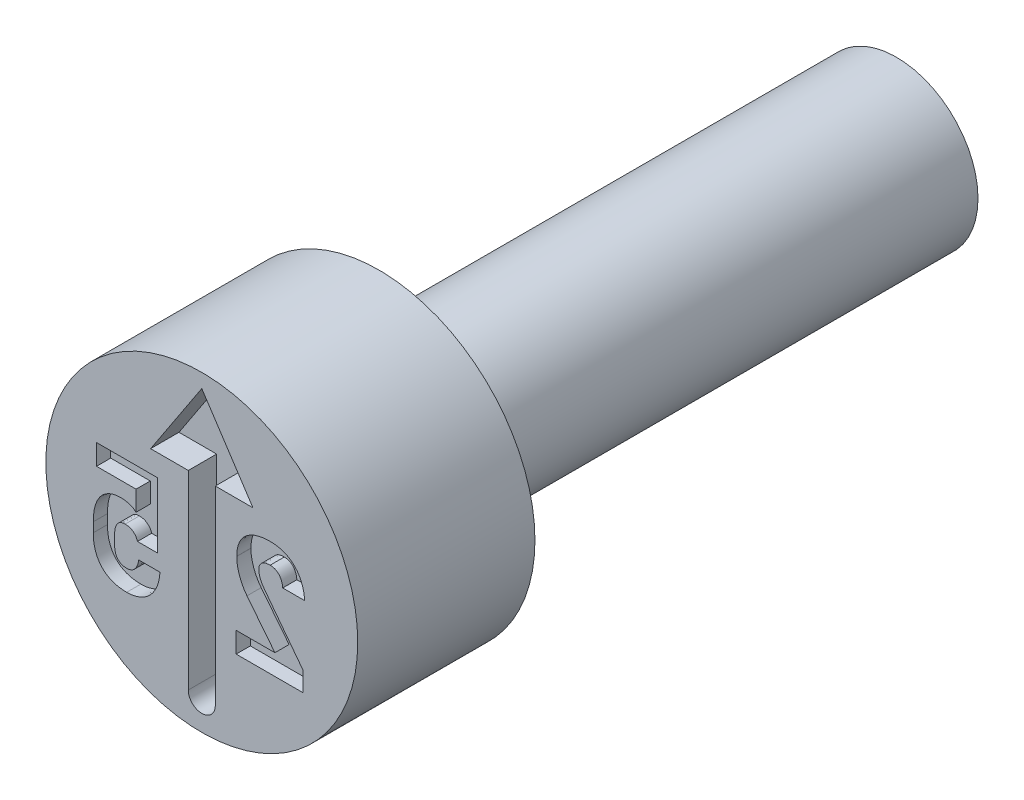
ISO-10303-21;
HEADER;
FILE_DESCRIPTION(('STEP AP214'),'2;1');
FILE_NAME('part.step','',(''),(''),'','','');
FILE_SCHEMA(('AUTOMOTIVE_DESIGN { 1 0 10303 214 1 1 1 1 }'));
ENDSEC;
DATA;
#1=APPLICATION_CONTEXT('core data for automotive mechanical design processes');
#2=APPLICATION_PROTOCOL_DEFINITION('international standard','automotive_design',2000,#1);
#3=PRODUCT_CONTEXT('',#1,'mechanical');
#4=PRODUCT('Part','Part','',(#3));
#5=PRODUCT_RELATED_PRODUCT_CATEGORY('part','',(#4));
#6=PRODUCT_DEFINITION_FORMATION('','',#4);
#7=PRODUCT_DEFINITION_CONTEXT('part definition',#1,'design');
#8=PRODUCT_DEFINITION('design','',#6,#7);
#9=PRODUCT_DEFINITION_SHAPE('','',#8);
#10=(LENGTH_UNIT() NAMED_UNIT(*) SI_UNIT(.MILLI.,.METRE.));
#11=(NAMED_UNIT(*) PLANE_ANGLE_UNIT() SI_UNIT($,.RADIAN.));
#12=(NAMED_UNIT(*) SI_UNIT($,.STERADIAN.) SOLID_ANGLE_UNIT());
#13=UNCERTAINTY_MEASURE_WITH_UNIT(LENGTH_MEASURE(1.E-05),#10,'distance_accuracy_value','');
#14=(GEOMETRIC_REPRESENTATION_CONTEXT(3) GLOBAL_UNCERTAINTY_ASSIGNED_CONTEXT((#13)) GLOBAL_UNIT_ASSIGNED_CONTEXT((#10,
#11,#12)) REPRESENTATION_CONTEXT('',''));
#15=CARTESIAN_POINT('',(0.,0.,0.));
#16=DIRECTION('',(0.,0.,1.));
#17=DIRECTION('',(1.,0.,0.));
#18=AXIS2_PLACEMENT_3D('',#15,#16,#17);
#19=CARTESIAN_POINT('',(0.,1.15,-2.5));
#20=DIRECTION('',(0.,0.,1.));
#21=DIRECTION('',(1.,0.,0.));
#22=AXIS2_PLACEMENT_3D('',#19,#20,#21);
#23=PLANE('',#22);
#24=CARTESIAN_POINT('',(0.,0.,-2.5));
#25=DIRECTION('',(0.,0.,1.));
#26=DIRECTION('',(1.,0.,0.));
#27=AXIS2_PLACEMENT_3D('',#24,#25,#26);
#28=CIRCLE('',#27,2.2);
#29=CARTESIAN_POINT('',(2.2,0.,-2.5));
#30=VERTEX_POINT('',#29);
#31=EDGE_CURVE('E11',#30,#30,#28,.T.);
#32=ORIENTED_EDGE('',*,*,#31,.F.);
#33=EDGE_LOOP('',(#32));
#34=FACE_BOUND('',#33,.T.);
#35=CARTESIAN_POINT('',(0.,0.,-2.5));
#36=DIRECTION('',(0.,0.,1.));
#37=DIRECTION('',(1.,0.,0.));
#38=AXIS2_PLACEMENT_3D('',#35,#36,#37);
#39=CIRCLE('',#38,1.15);
#40=CARTESIAN_POINT('',(1.15,0.,-2.5));
#41=VERTEX_POINT('',#40);
#42=EDGE_CURVE('E562',#41,#41,#39,.T.);
#43=ORIENTED_EDGE('',*,*,#42,.T.);
#44=EDGE_LOOP('',(#43));
#45=FACE_BOUND('',#44,.T.);
#46=ADVANCED_FACE('F34',(#34,#45),#23,.F.);
#47=CARTESIAN_POINT('',(0.,0.,-0.403888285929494));
#48=DIRECTION('',(0.,0.,1.));
#49=DIRECTION('',(1.,0.,0.));
#50=AXIS2_PLACEMENT_3D('',#47,#48,#49);
#51=CYLINDRICAL_SURFACE('',#50,2.2);
#52=CARTESIAN_POINT('',(0.,0.,0.));
#53=DIRECTION('',(0.,0.,1.));
#54=DIRECTION('',(1.,0.,0.));
#55=AXIS2_PLACEMENT_3D('',#52,#53,#54);
#56=CIRCLE('',#55,2.2);
#57=CARTESIAN_POINT('',(2.2,0.,0.));
#58=VERTEX_POINT('',#57);
#59=EDGE_CURVE('E41',#58,#58,#56,.T.);
#60=ORIENTED_EDGE('',*,*,#59,.F.);
#61=EDGE_LOOP('',(#60));
#62=FACE_BOUND('',#61,.T.);
#63=ORIENTED_EDGE('',*,*,#31,.T.);
#64=EDGE_LOOP('',(#63));
#65=FACE_BOUND('',#64,.T.);
#66=ADVANCED_FACE('F584',(#62,#65),#51,.T.);
#67=CARTESIAN_POINT('',(0.,2.2,0.));
#68=DIRECTION('',(0.,0.,-1.));
#69=DIRECTION('',(-1.,0.,0.));
#70=AXIS2_PLACEMENT_3D('',#67,#68,#69);
#71=PLANE('',#70);
#72=CARTESIAN_POINT('',(-1.05910535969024,-1.01662930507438,0.));
#73=CARTESIAN_POINT('',(-1.03807657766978,-1.01598774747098,0.));
#74=CARTESIAN_POINT('',(-0.996926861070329,-1.01473232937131,0.));
#75=CARTESIAN_POINT('',(-0.936945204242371,-1.00346213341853,0.));
#76=CARTESIAN_POINT('',(-0.88008064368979,-0.986008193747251,0.));
#77=CARTESIAN_POINT('',(-0.826756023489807,-0.961108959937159,0.));
#78=CARTESIAN_POINT('',(-0.777550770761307,-0.929475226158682,0.));
#79=CARTESIAN_POINT('',(-0.733552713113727,-0.890792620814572,0.));
#80=CARTESIAN_POINT('',(-0.694358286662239,-0.846073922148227,0.));
#81=CARTESIAN_POINT('',(-0.660753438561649,-0.794927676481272,0.));
#82=CARTESIAN_POINT('',(-0.633078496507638,-0.737901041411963,0.));
#83=CARTESIAN_POINT('',(-0.611533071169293,-0.675666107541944,0.));
#84=CARTESIAN_POINT('',(-0.596734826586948,-0.608334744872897,0.));
#85=CARTESIAN_POINT('',(-0.592432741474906,-0.561621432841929,0.));
#86=CARTESIAN_POINT('',(-0.590224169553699,-0.537640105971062,0.));
#87=B_SPLINE_CURVE_WITH_KNOTS('',3,(#72,#73,#74,#75,#76,#77,#78,#79,#80,#81,#82,#83,#84,#85,
#86),.UNSPECIFIED.,.F.,.F.,(4,1,1,1,1,1,1,1,1,1,1,1,4),(0.,0.0844304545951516,0.165215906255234,
0.244369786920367,0.322918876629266,0.40093676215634,0.478631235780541,0.557558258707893,
0.639203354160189,0.723781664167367,0.811629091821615,0.903295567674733,1.),.UNSPECIFIED.);
#88=CARTESIAN_POINT('',(-1.05910535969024,-1.01662930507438,0.));
#89=VERTEX_POINT('',#88);
#90=CARTESIAN_POINT('',(-0.590224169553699,-0.537640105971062,0.));
#91=VERTEX_POINT('',#90);
#92=EDGE_CURVE('E856',#89,#91,#87,.T.);
#93=ORIENTED_EDGE('',*,*,#92,.F.);
#94=CARTESIAN_POINT('',(-1.5309211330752,-0.525575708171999,0.));
#95=CARTESIAN_POINT('',(-1.53020686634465,-0.550495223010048,0.));
#96=CARTESIAN_POINT('',(-1.52882509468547,-0.598702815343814,0.));
#97=CARTESIAN_POINT('',(-1.51894397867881,-0.668414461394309,0.));
#98=CARTESIAN_POINT('',(-1.50113112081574,-0.732360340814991,0.));
#99=CARTESIAN_POINT('',(-1.47726451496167,-0.790953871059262,0.));
#100=CARTESIAN_POINT('',(-1.44609970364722,-0.843030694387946,0.));
#101=CARTESIAN_POINT('',(-1.40878169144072,-0.889030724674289,0.));
#102=CARTESIAN_POINT('',(-1.36462946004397,-0.927891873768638,0.));
#103=CARTESIAN_POINT('',(-1.31468502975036,-0.960596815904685,0.));
#104=CARTESIAN_POINT('',(-1.25847317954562,-0.985679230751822,0.));
#105=CARTESIAN_POINT('',(-1.19689217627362,-1.00390078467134,0.));
#106=CARTESIAN_POINT('',(-1.12969832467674,-1.01473905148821,0.));
#107=CARTESIAN_POINT('',(-1.08316632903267,-1.01598502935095,0.));
#108=CARTESIAN_POINT('',(-1.05910535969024,-1.01662930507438,0.));
#109=B_SPLINE_CURVE_WITH_KNOTS('',3,(#94,#95,#96,#97,#98,#99,#100,#101,#102,#103,#104,#105,#106,
#107,#108),.UNSPECIFIED.,.F.,.F.,(4,1,1,1,1,1,1,1,1,1,1,1,4),(0.,0.0965919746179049,
0.1868602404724,0.272108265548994,0.35332451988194,0.431359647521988,0.506505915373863,
0.582010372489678,0.6584354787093,0.737063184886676,0.819709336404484,0.906774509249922,1.),.UNSPECIFIED.);
#110=CARTESIAN_POINT('',(-1.5309211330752,-0.525575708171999,0.));
#111=VERTEX_POINT('',#110);
#112=EDGE_CURVE('E48',#111,#89,#109,.T.);
#113=ORIENTED_EDGE('',*,*,#112,.F.);
#114=DIRECTION('',(0.,-1.,0.));
#115=VECTOR('',#114,1.);
#116=CARTESIAN_POINT('',(-1.5309211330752,-0.391563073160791,0.));
#117=LINE('',#116,#115);
#118=CARTESIAN_POINT('',(-1.5309211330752,-0.391563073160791,0.));
#119=VERTEX_POINT('',#118);
#120=EDGE_CURVE('E329',#119,#111,#117,.T.);
#121=ORIENTED_EDGE('',*,*,#120,.F.);
#122=CARTESIAN_POINT('',(-1.13703484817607,0.0981862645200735,0.));
#123=CARTESIAN_POINT('',(-1.15708736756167,0.097551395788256,0.));
#124=CARTESIAN_POINT('',(-1.19597886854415,0.0963200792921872,0.));
#125=CARTESIAN_POINT('',(-1.25207669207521,0.0852440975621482,0.));
#126=CARTESIAN_POINT('',(-1.30377604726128,0.0674992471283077,0.));
#127=CARTESIAN_POINT('',(-1.35065032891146,0.0419340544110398,0.));
#128=CARTESIAN_POINT('',(-1.39275255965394,0.00989195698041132,0.));
#129=CARTESIAN_POINT('',(-1.42932152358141,-0.0292608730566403,0.));
#130=CARTESIAN_POINT('',(-1.46058518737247,-0.074886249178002,0.));
#131=CARTESIAN_POINT('',(-1.48617181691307,-0.127014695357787,0.));
#132=CARTESIAN_POINT('',(-1.50630957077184,-0.185189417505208,0.));
#133=CARTESIAN_POINT('',(-1.52093622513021,-0.249004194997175,0.));
#134=CARTESIAN_POINT('',(-1.52927161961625,-0.318520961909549,0.));
#135=CARTESIAN_POINT('',(-1.5303585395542,-0.366650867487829,0.));
#136=CARTESIAN_POINT('',(-1.5309211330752,-0.391563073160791,0.));
#137=B_SPLINE_CURVE_WITH_KNOTS('',3,(#122,#123,#124,#125,#126,#127,#128,#129,#130,#131,#132,
#133,#134,#135,#136),.UNSPECIFIED.,.F.,.F.,(4,1,1,1,1,1,1,1,1,1,1,1,4),(0.,0.0843949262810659,
0.163682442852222,0.239848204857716,0.313806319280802,0.3876154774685,0.461788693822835,
0.538496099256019,0.61978489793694,0.70565234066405,0.797279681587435,0.895071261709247,1.),.UNSPECIFIED.);
#138=CARTESIAN_POINT('',(-1.13703484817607,0.0981862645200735,0.));
#139=VERTEX_POINT('',#138);
#140=EDGE_CURVE('E332',#139,#119,#137,.T.);
#141=ORIENTED_EDGE('',*,*,#140,.F.);
#142=CARTESIAN_POINT('',(-0.927049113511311,0.0267780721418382,0.));
#143=CARTESIAN_POINT('',(-0.933119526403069,0.0321532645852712,0.));
#144=CARTESIAN_POINT('',(-0.945606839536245,0.0432104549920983,0.));
#145=CARTESIAN_POINT('',(-0.96743825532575,0.057250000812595,0.));
#146=CARTESIAN_POINT('',(-0.992406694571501,0.0691742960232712,0.));
#147=CARTESIAN_POINT('',(-1.02924994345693,0.0829078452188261,0.));
#148=CARTESIAN_POINT('',(-1.07771564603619,0.0951202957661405,0.));
#149=CARTESIAN_POINT('',(-1.11750259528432,0.0971767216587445,0.));
#150=CARTESIAN_POINT('',(-1.13703484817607,0.0981862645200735,0.));
#151=B_SPLINE_CURVE_WITH_KNOTS('',3,(#142,#143,#144,#145,#146,#147,#148,#149,#150),
.UNSPECIFIED.,.F.,.F.,(4,1,1,1,1,1,4),(0.,0.10729164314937,0.220707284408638,0.342410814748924,
0.47317918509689,0.741372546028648,1.),.UNSPECIFIED.);
#152=CARTESIAN_POINT('',(-0.927049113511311,0.0267780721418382,0.));
#153=VERTEX_POINT('',#152);
#154=EDGE_CURVE('E783',#153,#139,#151,.T.);
#155=ORIENTED_EDGE('',*,*,#154,.F.);
#156=DIRECTION('',(0.,-1.,0.));
#157=VECTOR('',#156,1.);
#158=CARTESIAN_POINT('',(-0.927049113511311,0.309476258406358,0.));
#159=LINE('',#158,#157);
#160=CARTESIAN_POINT('',(-0.927049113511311,0.309476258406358,0.));
#161=VERTEX_POINT('',#160);
#162=EDGE_CURVE('E791',#161,#153,#159,.T.);
#163=ORIENTED_EDGE('',*,*,#162,.F.);
#164=DIRECTION('',(1.,0.,0.));
#165=VECTOR('',#164,1.);
#166=CARTESIAN_POINT('',(-1.48494599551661,0.309476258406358,0.));
#167=LINE('',#166,#165);
#168=CARTESIAN_POINT('',(-1.48494599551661,0.309476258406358,0.));
#169=VERTEX_POINT('',#168);
#170=EDGE_CURVE('E797',#169,#161,#167,.T.);
#171=ORIENTED_EDGE('',*,*,#170,.F.);
#172=DIRECTION('',(0.,-1.,0.));
#173=VECTOR('',#172,1.);
#174=CARTESIAN_POINT('',(-1.48494599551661,0.6,0.));
#175=LINE('',#174,#173);
#176=CARTESIAN_POINT('',(-1.48494599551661,0.6,0.));
#177=VERTEX_POINT('',#176);
#178=EDGE_CURVE('E800',#177,#169,#175,.T.);
#179=ORIENTED_EDGE('',*,*,#178,.F.);
#180=DIRECTION('',(-1.,0.,0.));
#181=VECTOR('',#180,1.);
#182=CARTESIAN_POINT('',(-0.625439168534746,0.6,0.));
#183=LINE('',#182,#181);
#184=CARTESIAN_POINT('',(-0.625439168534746,0.6,0.));
#185=VERTEX_POINT('',#184);
#186=EDGE_CURVE('E803',#185,#177,#183,.T.);
#187=ORIENTED_EDGE('',*,*,#186,.F.);
#188=DIRECTION('',(0.,1.,0.));
#189=VECTOR('',#188,1.);
#190=CARTESIAN_POINT('',(-0.625439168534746,-0.319828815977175,0.));
#191=LINE('',#190,#189);
#192=CARTESIAN_POINT('',(-0.625439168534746,-0.319828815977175,0.));
#193=VERTEX_POINT('',#192);
#194=EDGE_CURVE('E806',#193,#185,#191,.T.);
#195=ORIENTED_EDGE('',*,*,#194,.F.);
#196=DIRECTION('',(1.,0.,0.));
#197=VECTOR('',#196,1.);
#198=CARTESIAN_POINT('',(-0.907159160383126,-0.319828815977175,0.));
#199=LINE('',#198,#197);
#200=CARTESIAN_POINT('',(-0.907159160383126,-0.319828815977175,0.));
#201=VERTEX_POINT('',#200);
#202=EDGE_CURVE('E809',#201,#193,#199,.T.);
#203=ORIENTED_EDGE('',*,*,#202,.F.);
#204=CARTESIAN_POINT('',(-1.0809517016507,-0.194293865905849,0.));
#205=CARTESIAN_POINT('',(-1.07048342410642,-0.194613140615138,0.));
#206=CARTESIAN_POINT('',(-1.05021722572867,-0.195231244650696,0.));
#207=CARTESIAN_POINT('',(-1.02103707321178,-0.201631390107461,0.));
#208=CARTESIAN_POINT('',(-0.994217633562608,-0.212102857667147,0.));
#209=CARTESIAN_POINT('',(-0.970063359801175,-0.226907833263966,0.));
#210=CARTESIAN_POINT('',(-0.948729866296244,-0.245053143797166,0.));
#211=CARTESIAN_POINT('',(-0.931165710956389,-0.266978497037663,0.));
#212=CARTESIAN_POINT('',(-0.916441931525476,-0.291752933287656,0.));
#213=CARTESIAN_POINT('',(-0.910298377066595,-0.310334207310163,0.));
#214=CARTESIAN_POINT('',(-0.907159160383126,-0.319828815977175,0.));
#215=B_SPLINE_CURVE_WITH_KNOTS('',3,(#204,#205,#206,#207,#208,#209,#210,#211,#212,#213,#214),
.UNSPECIFIED.,.F.,.F.,(4,1,1,1,1,1,1,1,4),(0.,0.135635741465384,0.262585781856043,
0.385395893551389,0.507524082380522,0.628507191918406,0.746772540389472,0.870606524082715,1.),.UNSPECIFIED.);
#216=CARTESIAN_POINT('',(-1.0809517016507,-0.194293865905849,0.));
#217=VERTEX_POINT('',#216);
#218=EDGE_CURVE('E812',#217,#201,#215,.T.);
#219=ORIENTED_EDGE('',*,*,#218,.F.);
#220=CARTESIAN_POINT('',(-1.22963725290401,-0.391563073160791,0.));
#221=CARTESIAN_POINT('',(-1.22931523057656,-0.376633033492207,0.));
#222=CARTESIAN_POINT('',(-1.2287040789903,-0.348297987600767,0.));
#223=CARTESIAN_POINT('',(-1.22110137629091,-0.30866147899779,0.));
#224=CARTESIAN_POINT('',(-1.20928067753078,-0.274079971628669,0.));
#225=CARTESIAN_POINT('',(-1.19182315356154,-0.245372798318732,0.));
#226=CARTESIAN_POINT('',(-1.17012165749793,-0.222201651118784,0.));
#227=CARTESIAN_POINT('',(-1.14386016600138,-0.205744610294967,0.));
#228=CARTESIAN_POINT('',(-1.11356615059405,-0.196024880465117,0.));
#229=CARTESIAN_POINT('',(-1.09211107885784,-0.194886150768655,0.));
#230=CARTESIAN_POINT('',(-1.0809517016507,-0.194293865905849,0.));
#231=B_SPLINE_CURVE_WITH_KNOTS('',3,(#220,#221,#222,#223,#224,#225,#226,#227,#228,#229,#230),
.UNSPECIFIED.,.F.,.F.,(4,1,1,1,1,1,1,1,4),(0.,0.160198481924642,0.304033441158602,
0.431843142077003,0.550810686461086,0.662316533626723,0.769888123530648,0.880312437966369,1.),.UNSPECIFIED.);
#232=CARTESIAN_POINT('',(-1.22963725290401,-0.391563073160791,0.));
#233=VERTEX_POINT('',#232);
#234=EDGE_CURVE('E817',#233,#217,#231,.T.);
#235=ORIENTED_EDGE('',*,*,#234,.F.);
#236=DIRECTION('',(0.,1.,0.));
#237=VECTOR('',#236,1.);
#238=CARTESIAN_POINT('',(-1.22963725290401,-0.525575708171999,0.));
#239=LINE('',#238,#237);
#240=CARTESIAN_POINT('',(-1.22963725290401,-0.525575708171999,0.));
#241=VERTEX_POINT('',#240);
#242=EDGE_CURVE('E825',#241,#233,#239,.T.);
#243=ORIENTED_EDGE('',*,*,#242,.F.);
#244=CARTESIAN_POINT('',(-1.06334420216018,-0.723823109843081,0.));
#245=CARTESIAN_POINT('',(-1.07591965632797,-0.723275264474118,0.));
#246=CARTESIAN_POINT('',(-1.0999732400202,-0.722227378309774,0.));
#247=CARTESIAN_POINT('',(-1.13368831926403,-0.712113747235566,0.));
#248=CARTESIAN_POINT('',(-1.16303856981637,-0.695921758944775,0.));
#249=CARTESIAN_POINT('',(-1.18728192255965,-0.67262230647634,0.));
#250=CARTESIAN_POINT('',(-1.20662194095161,-0.643591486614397,0.));
#251=CARTESIAN_POINT('',(-1.220311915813,-0.608826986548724,0.));
#252=CARTESIAN_POINT('',(-1.22841955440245,-0.568880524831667,0.));
#253=CARTESIAN_POINT('',(-1.22921740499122,-0.54050669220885,0.));
#254=CARTESIAN_POINT('',(-1.22963725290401,-0.525575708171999,0.));
#255=B_SPLINE_CURVE_WITH_KNOTS('',3,(#244,#245,#246,#247,#248,#249,#250,#251,#252,#253,#254),
.UNSPECIFIED.,.F.,.F.,(4,1,1,1,1,1,1,1,4),(0.,0.128261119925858,0.245330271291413,
0.356275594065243,0.467886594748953,0.585607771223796,0.710231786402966,0.847517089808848,1.),.UNSPECIFIED.);
#256=CARTESIAN_POINT('',(-1.06334420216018,-0.723823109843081,0.));
#257=VERTEX_POINT('',#256);
#258=EDGE_CURVE('E831',#257,#241,#255,.T.);
#259=ORIENTED_EDGE('',*,*,#258,.F.);
#260=CARTESIAN_POINT('',(-0.891834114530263,-0.537640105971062,0.));
#261=CARTESIAN_POINT('',(-0.893555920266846,-0.551644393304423,0.));
#262=CARTESIAN_POINT('',(-0.89683723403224,-0.578332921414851,0.));
#263=CARTESIAN_POINT('',(-0.908669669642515,-0.615368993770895,0.));
#264=CARTESIAN_POINT('',(-0.924117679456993,-0.647923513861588,0.));
#265=CARTESIAN_POINT('',(-0.944523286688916,-0.675239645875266,0.));
#266=CARTESIAN_POINT('',(-0.968755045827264,-0.697416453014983,0.));
#267=CARTESIAN_POINT('',(-0.99746887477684,-0.712457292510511,0.));
#268=CARTESIAN_POINT('',(-1.02920347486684,-0.722493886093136,0.));
#269=CARTESIAN_POINT('',(-1.05174232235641,-0.723371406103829,0.));
#270=CARTESIAN_POINT('',(-1.06334420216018,-0.723823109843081,0.));
#271=B_SPLINE_CURVE_WITH_KNOTS('',3,(#260,#261,#262,#263,#264,#265,#266,#267,#268,#269,#270),
.UNSPECIFIED.,.F.,.F.,(4,1,1,1,1,1,1,1,4),(0.,0.150277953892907,0.286390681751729,
0.412971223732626,0.533144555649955,0.648163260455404,0.760273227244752,0.876600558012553,1.),.UNSPECIFIED.);
#272=CARTESIAN_POINT('',(-0.891834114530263,-0.537640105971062,0.));
#273=VERTEX_POINT('',#272);
#274=EDGE_CURVE('E836',#273,#257,#271,.T.);
#275=ORIENTED_EDGE('',*,*,#274,.F.);
#276=DIRECTION('',(0.,-1.,0.));
#277=VECTOR('',#276,1.);
#278=CARTESIAN_POINT('',(-0.891834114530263,-0.536661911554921,0.));
#279=LINE('',#278,#277);
#280=CARTESIAN_POINT('',(-0.891834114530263,-0.536661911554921,0.));
#281=VERTEX_POINT('',#280);
#282=EDGE_CURVE('E844',#281,#273,#279,.T.);
#283=ORIENTED_EDGE('',*,*,#282,.F.);
#284=DIRECTION('',(-1.,0.,0.));
#285=VECTOR('',#284,1.);
#286=CARTESIAN_POINT('',(-0.590224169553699,-0.536661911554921,0.));
#287=LINE('',#286,#285);
#288=CARTESIAN_POINT('',(-0.590224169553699,-0.536661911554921,0.));
#289=VERTEX_POINT('',#288);
#290=EDGE_CURVE('E850',#289,#281,#287,.T.);
#291=ORIENTED_EDGE('',*,*,#290,.F.);
#292=DIRECTION('',(0.,1.,0.));
#293=VECTOR('',#292,1.);
#294=CARTESIAN_POINT('',(-0.590224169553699,-0.537640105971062,0.));
#295=LINE('',#294,#293);
#296=EDGE_CURVE('E853',#91,#289,#295,.T.);
#297=ORIENTED_EDGE('',*,*,#296,.F.);
#298=EDGE_LOOP('',(#93,#113,#121,#141,#155,#163,#171,#179,#187,#195,#203,#219,#235,#243,#259,
#275,#283,#291,#297));
#299=FACE_BOUND('',#298,.T.);
#300=DIRECTION('',(-0.60539313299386,0.795926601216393,0.));
#301=VECTOR('',#300,1.);
#302=CARTESIAN_POINT('',(1.43098634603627,-0.728061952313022,0.));
#303=LINE('',#302,#301);
#304=CARTESIAN_POINT('',(1.43098634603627,-0.728061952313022,0.));
#305=VERTEX_POINT('',#304);
#306=CARTESIAN_POINT('',(0.881893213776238,-0.00615447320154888,0.));
#307=VERTEX_POINT('',#306);
#308=EDGE_CURVE('E405',#305,#307,#303,.T.);
#309=ORIENTED_EDGE('',*,*,#308,.F.);
#310=DIRECTION('',(0.,1.,0.));
#311=VECTOR('',#310,1.);
#312=CARTESIAN_POINT('',(1.43098634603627,-1.,0.));
#313=LINE('',#312,#311);
#314=CARTESIAN_POINT('',(1.43098634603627,-1.,0.));
#315=VERTEX_POINT('',#314);
#316=EDGE_CURVE('E56',#315,#305,#313,.T.);
#317=ORIENTED_EDGE('',*,*,#316,.F.);
#318=DIRECTION('',(1.,0.,0.));
#319=VECTOR('',#318,1.);
#320=CARTESIAN_POINT('',(0.484746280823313,-1.,0.));
#321=LINE('',#320,#319);
#322=CARTESIAN_POINT('',(0.484746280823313,-1.,0.));
#323=VERTEX_POINT('',#322);
#324=EDGE_CURVE('E481',#323,#315,#321,.T.);
#325=ORIENTED_EDGE('',*,*,#324,.F.);
#326=DIRECTION('',(0.,-1.,0.));
#327=VECTOR('',#326,1.);
#328=CARTESIAN_POINT('',(0.484746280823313,-0.709476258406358,0.));
#329=LINE('',#328,#327);
#330=CARTESIAN_POINT('',(0.484746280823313,-0.709476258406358,0.));
#331=VERTEX_POINT('',#330);
#332=EDGE_CURVE('E478',#331,#323,#329,.T.);
#333=ORIENTED_EDGE('',*,*,#332,.F.);
#334=DIRECTION('',(-1.,0.,0.));
#335=VECTOR('',#334,1.);
#336=CARTESIAN_POINT('',(1.03155695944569,-0.709476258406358,0.));
#337=LINE('',#336,#335);
#338=CARTESIAN_POINT('',(1.03155695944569,-0.709476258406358,0.));
#339=VERTEX_POINT('',#338);
#340=EDGE_CURVE('E475',#339,#331,#337,.T.);
#341=ORIENTED_EDGE('',*,*,#340,.F.);
#342=DIRECTION('',(0.620676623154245,-0.78406666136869,0.));
#343=VECTOR('',#342,1.);
#344=CARTESIAN_POINT('',(0.637670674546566,-0.211901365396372,0.));
#345=LINE('',#344,#343);
#346=CARTESIAN_POINT('',(0.637670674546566,-0.211901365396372,0.));
#347=VERTEX_POINT('',#346);
#348=EDGE_CURVE('E469',#347,#339,#345,.T.);
#349=ORIENTED_EDGE('',*,*,#348,.F.);
#350=CARTESIAN_POINT('',(0.493550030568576,0.198288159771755,0.));
#351=CARTESIAN_POINT('',(0.493968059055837,0.180114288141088,0.));
#352=CARTESIAN_POINT('',(0.494804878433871,0.143733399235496,0.));
#353=CARTESIAN_POINT('',(0.502268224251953,0.0893814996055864,0.));
#354=CARTESIAN_POINT('',(0.514471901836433,0.035343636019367,0.));
#355=CARTESIAN_POINT('',(0.531030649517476,-0.0181908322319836,0.));
#356=CARTESIAN_POINT('',(0.551707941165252,-0.0703279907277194,0.));
#357=CARTESIAN_POINT('',(0.576384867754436,-0.120237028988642,0.));
#358=CARTESIAN_POINT('',(0.604558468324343,-0.167790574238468,0.));
#359=CARTESIAN_POINT('',(0.626634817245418,-0.19719982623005,0.));
#360=CARTESIAN_POINT('',(0.637670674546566,-0.211901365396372,0.));
#361=B_SPLINE_CURVE_WITH_KNOTS('',3,(#350,#351,#352,#353,#354,#355,#356,#357,#358,#359,#360),
.UNSPECIFIED.,.F.,.F.,(4,1,1,1,1,1,1,1,4),(0.,0.123148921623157,0.246522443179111,
0.371108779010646,0.498350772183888,0.625999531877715,0.750879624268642,0.875465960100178,1.),.UNSPECIFIED.);
#362=CARTESIAN_POINT('',(0.493550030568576,0.198288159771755,0.));
#363=VERTEX_POINT('',#362);
#364=EDGE_CURVE('E464',#363,#347,#361,.T.);
#365=ORIENTED_EDGE('',*,*,#364,.F.);
#366=DIRECTION('',(0.,-1.,0.));
#367=VECTOR('',#366,1.);
#368=CARTESIAN_POINT('',(0.493550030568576,0.199592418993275,0.));
#369=LINE('',#368,#367);
#370=CARTESIAN_POINT('',(0.493550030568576,0.199592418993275,0.));
#371=VERTEX_POINT('',#370);
#372=EDGE_CURVE('E458',#371,#363,#369,.T.);
#373=ORIENTED_EDGE('',*,*,#372,.F.);
#374=CARTESIAN_POINT('',(0.966670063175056,0.616629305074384,0.));
#375=CARTESIAN_POINT('',(0.942620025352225,0.616126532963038,0.));
#376=CARTESIAN_POINT('',(0.896072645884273,0.615153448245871,0.));
#377=CARTESIAN_POINT('',(0.829047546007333,0.605992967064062,0.));
#378=CARTESIAN_POINT('',(0.767416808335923,0.590748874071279,0.));
#379=CARTESIAN_POINT('',(0.711335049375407,0.569331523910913,0.));
#380=CARTESIAN_POINT('',(0.661170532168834,0.541800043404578,0.));
#381=CARTESIAN_POINT('',(0.616691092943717,0.509120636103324,0.));
#382=CARTESIAN_POINT('',(0.579152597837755,0.470024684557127,0.));
#383=CARTESIAN_POINT('',(0.547927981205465,0.425611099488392,0.));
#384=CARTESIAN_POINT('',(0.523313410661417,0.376051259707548,0.));
#385=CARTESIAN_POINT('',(0.506075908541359,0.321387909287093,0.));
#386=CARTESIAN_POINT('',(0.495519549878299,0.26206013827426,0.));
#387=CARTESIAN_POINT('',(0.494219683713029,0.220831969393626,0.));
#388=CARTESIAN_POINT('',(0.493550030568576,0.199592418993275,0.));
#389=B_SPLINE_CURVE_WITH_KNOTS('',3,(#374,#375,#376,#377,#378,#379,#380,#381,#382,#383,#384,
#385,#386,#387,#388),.UNSPECIFIED.,.F.,.F.,(4,1,1,1,1,1,1,1,1,1,1,1,4),(0.,0.100715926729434,
0.194929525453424,0.282728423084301,0.36619186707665,0.44566981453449,0.521804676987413,
0.596515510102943,0.671682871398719,0.748455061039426,0.827368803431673,0.911065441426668,1.),.UNSPECIFIED.);
#390=CARTESIAN_POINT('',(0.966670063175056,0.616629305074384,0.));
#391=VERTEX_POINT('',#390);
#392=EDGE_CURVE('E450',#391,#371,#389,.T.);
#393=ORIENTED_EDGE('',*,*,#392,.F.);
#394=CARTESIAN_POINT('',(1.45087629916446,0.137966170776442,0.));
#395=CARTESIAN_POINT('',(1.44866149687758,0.162053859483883,0.));
#396=CARTESIAN_POINT('',(1.44434692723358,0.20897814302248,0.));
#397=CARTESIAN_POINT('',(1.42967616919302,0.276459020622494,0.));
#398=CARTESIAN_POINT('',(1.4080032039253,0.338551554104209,0.));
#399=CARTESIAN_POINT('',(1.38031298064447,0.395427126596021,0.));
#400=CARTESIAN_POINT('',(1.34635993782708,0.446367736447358,0.));
#401=CARTESIAN_POINT('',(1.30696430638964,0.491359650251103,0.));
#402=CARTESIAN_POINT('',(1.26168975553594,0.529528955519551,0.));
#403=CARTESIAN_POINT('',(1.21132050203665,0.561246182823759,0.));
#404=CARTESIAN_POINT('',(1.15607654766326,0.586068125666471,0.));
#405=CARTESIAN_POINT('',(1.09663349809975,0.604153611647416,0.));
#406=CARTESIAN_POINT('',(1.03290182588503,0.614579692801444,0.));
#407=CARTESIAN_POINT('',(0.989097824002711,0.615935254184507,0.));
#408=CARTESIAN_POINT('',(0.966670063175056,0.616629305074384,0.));
#409=B_SPLINE_CURVE_WITH_KNOTS('',3,(#394,#395,#396,#397,#398,#399,#400,#401,#402,#403,#404,
#405,#406,#407,#408),.UNSPECIFIED.,.F.,.F.,(4,1,1,1,1,1,1,1,1,1,1,1,4),(0.,0.0953291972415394,
0.185707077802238,0.271513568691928,0.35413169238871,0.434493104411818,0.512233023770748,
0.58917600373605,0.667186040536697,0.746219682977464,0.827302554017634,0.911578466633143,1.),.UNSPECIFIED.);
#410=CARTESIAN_POINT('',(1.45087629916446,0.137966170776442,0.));
#411=VERTEX_POINT('',#410);
#412=EDGE_CURVE('E445',#411,#391,#409,.T.);
#413=ORIENTED_EDGE('',*,*,#412,.F.);
#414=DIRECTION('',(0.,1.,0.));
#415=VECTOR('',#414,1.);
#416=CARTESIAN_POINT('',(1.45087629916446,0.136661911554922,0.));
#417=LINE('',#416,#415);
#418=CARTESIAN_POINT('',(1.45087629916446,0.136661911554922,0.));
#419=VERTEX_POINT('',#418);
#420=EDGE_CURVE('E442',#419,#411,#417,.T.);
#421=ORIENTED_EDGE('',*,*,#420,.F.);
#422=DIRECTION('',(1.,0.,0.));
#423=VECTOR('',#422,1.);
#424=CARTESIAN_POINT('',(1.14176686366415,0.136661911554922,0.));
#425=LINE('',#424,#423);
#426=CARTESIAN_POINT('',(1.14176686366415,0.136661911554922,0.));
#427=VERTEX_POINT('',#426);
#428=EDGE_CURVE('E439',#427,#419,#425,.T.);
#429=ORIENTED_EDGE('',*,*,#428,.F.);
#430=DIRECTION('',(0.,-1.,0.));
#431=VECTOR('',#430,1.);
#432=CARTESIAN_POINT('',(1.14176686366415,0.137966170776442,0.));
#433=LINE('',#432,#431);
#434=CARTESIAN_POINT('',(1.14176686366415,0.137966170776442,0.));
#435=VERTEX_POINT('',#434);
#436=EDGE_CURVE('E433',#435,#427,#433,.T.);
#437=ORIENTED_EDGE('',*,*,#436,.F.);
#438=CARTESIAN_POINT('',(0.964387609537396,0.326105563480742,0.));
#439=CARTESIAN_POINT('',(0.976295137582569,0.325602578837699,0.));
#440=CARTESIAN_POINT('',(0.999403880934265,0.324626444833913,0.));
#441=CARTESIAN_POINT('',(1.03227623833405,0.315324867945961,0.));
#442=CARTESIAN_POINT('',(1.06147786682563,0.299533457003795,0.));
#443=CARTESIAN_POINT('',(1.08675660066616,0.277709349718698,0.));
#444=CARTESIAN_POINT('',(1.10796774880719,0.250254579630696,0.));
#445=CARTESIAN_POINT('',(1.12360194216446,0.217180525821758,0.));
#446=CARTESIAN_POINT('',(1.13619241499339,0.179590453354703,0.));
#447=CARTESIAN_POINT('',(1.13984615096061,0.152308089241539,0.));
#448=CARTESIAN_POINT('',(1.14176686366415,0.137966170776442,0.));
#449=B_SPLINE_CURVE_WITH_KNOTS('',3,(#438,#439,#440,#441,#442,#443,#444,#445,#446,#447,#448),
.UNSPECIFIED.,.F.,.F.,(4,1,1,1,1,1,1,1,4),(0.,0.124212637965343,0.241057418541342,
0.353359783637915,0.468536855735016,0.587568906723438,0.713021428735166,0.849139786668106,1.),.UNSPECIFIED.);
#450=CARTESIAN_POINT('',(0.964387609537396,0.326105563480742,0.));
#451=VERTEX_POINT('',#450);
#452=EDGE_CURVE('E425',#451,#435,#449,.T.);
#453=ORIENTED_EDGE('',*,*,#452,.F.);
#454=CARTESIAN_POINT('',(0.803963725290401,0.190788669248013,0.));
#455=CARTESIAN_POINT('',(0.804401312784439,0.201062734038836,0.));
#456=CARTESIAN_POINT('',(0.80523520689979,0.220641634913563,0.));
#457=CARTESIAN_POINT('',(0.813285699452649,0.248187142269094,0.));
#458=CARTESIAN_POINT('',(0.826598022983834,0.272006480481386,0.));
#459=CARTESIAN_POINT('',(0.845244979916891,0.29197384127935,0.));
#460=CARTESIAN_POINT('',(0.868964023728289,0.307319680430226,0.));
#461=CARTESIAN_POINT('',(0.896942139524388,0.318529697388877,0.));
#462=CARTESIAN_POINT('',(0.929328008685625,0.324872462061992,0.));
#463=CARTESIAN_POINT('',(0.952295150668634,0.325680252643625,0.));
#464=CARTESIAN_POINT('',(0.964387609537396,0.326105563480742,0.));
#465=B_SPLINE_CURVE_WITH_KNOTS('',3,(#454,#455,#456,#457,#458,#459,#460,#461,#462,#463,#464),
.UNSPECIFIED.,.F.,.F.,(4,1,1,1,1,1,1,1,4),(0.,0.129170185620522,0.246154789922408,
0.357734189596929,0.470108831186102,0.586692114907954,0.710769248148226,0.847716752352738,1.),.UNSPECIFIED.);
#466=CARTESIAN_POINT('',(0.803963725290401,0.190788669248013,0.));
#467=VERTEX_POINT('',#466);
#468=EDGE_CURVE('E420',#467,#451,#465,.T.);
#469=ORIENTED_EDGE('',*,*,#468,.F.);
#470=DIRECTION('',(0.,1.,0.));
#471=VECTOR('',#470,1.);
#472=CARTESIAN_POINT('',(0.803963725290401,0.188506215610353,0.));
#473=LINE('',#472,#471);
#474=CARTESIAN_POINT('',(0.803963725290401,0.188506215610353,0.));
#475=VERTEX_POINT('',#474);
#476=EDGE_CURVE('E414',#475,#467,#473,.T.);
#477=ORIENTED_EDGE('',*,*,#476,.F.);
#478=CARTESIAN_POINT('',(0.881893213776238,-0.00615447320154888,0.));
#479=CARTESIAN_POINT('',(0.870377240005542,0.0098228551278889,0.));
#480=CARTESIAN_POINT('',(0.847895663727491,0.0410139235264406,0.));
#481=CARTESIAN_POINT('',(0.827781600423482,0.0840351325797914,0.));
#482=CARTESIAN_POINT('',(0.815003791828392,0.117768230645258,0.));
#483=CARTESIAN_POINT('',(0.809096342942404,0.142237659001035,0.));
#484=CARTESIAN_POINT('',(0.804723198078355,0.165635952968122,0.));
#485=CARTESIAN_POINT('',(0.804213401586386,0.180987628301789,0.));
#486=CARTESIAN_POINT('',(0.803963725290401,0.188506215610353,0.));
#487=B_SPLINE_CURVE_WITH_KNOTS('',3,(#478,#479,#480,#481,#482,#483,#484,#485,#486),
.UNSPECIFIED.,.F.,.F.,(4,1,1,1,1,1,4),(0.,0.27673722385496,0.540248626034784,0.66563356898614,
0.784034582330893,0.894229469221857,1.),.UNSPECIFIED.);
#488=EDGE_CURVE('E409',#307,#475,#487,.T.);
#489=ORIENTED_EDGE('',*,*,#488,.F.);
#490=EDGE_LOOP('',(#309,#317,#325,#333,#341,#349,#365,#373,#393,#413,#421,#429,#437,#453,#469,
#477,#489));
#491=FACE_BOUND('',#490,.T.);
#492=DIRECTION('',(0.,1.,0.));
#493=VECTOR('',#492,1.);
#494=CARTESIAN_POINT('',(0.190473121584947,0.906351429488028,0.));
#495=LINE('',#494,#493);
#496=CARTESIAN_POINT('',(0.190473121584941,-1.77616183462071,0.));
#497=VERTEX_POINT('',#496);
#498=CARTESIAN_POINT('',(0.190473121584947,0.906351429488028,0.));
#499=VERTEX_POINT('',#498);
#500=EDGE_CURVE('E543',#497,#499,#495,.T.);
#501=ORIENTED_EDGE('',*,*,#500,.F.);
#502=CARTESIAN_POINT('',(1.6342449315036E-13,-1.77616183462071,0.));
#503=DIRECTION('',(0.,0.,1.));
#504=DIRECTION('',(1.,0.,0.));
#505=AXIS2_PLACEMENT_3D('',#502,#503,#504);
#506=CIRCLE('',#505,0.190473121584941);
#507=CARTESIAN_POINT('',(-0.190473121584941,-1.77616183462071,0.));
#508=VERTEX_POINT('',#507);
#509=EDGE_CURVE('E487',#508,#497,#506,.T.);
#510=ORIENTED_EDGE('',*,*,#509,.F.);
#511=DIRECTION('',(0.,-1.,0.));
#512=VECTOR('',#511,1.);
#513=CARTESIAN_POINT('',(-0.190473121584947,0.906351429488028,0.));
#514=LINE('',#513,#512);
#515=CARTESIAN_POINT('',(-0.190473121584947,0.906351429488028,0.));
#516=VERTEX_POINT('',#515);
#517=EDGE_CURVE('E523',#516,#508,#514,.T.);
#518=ORIENTED_EDGE('',*,*,#517,.F.);
#519=DIRECTION('',(1.,0.,0.));
#520=VECTOR('',#519,1.);
#521=CARTESIAN_POINT('',(-0.721917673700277,0.906351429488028,0.));
#522=LINE('',#521,#520);
#523=CARTESIAN_POINT('',(-0.721917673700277,0.906351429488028,0.));
#524=VERTEX_POINT('',#523);
#525=EDGE_CURVE('E555',#524,#516,#522,.T.);
#526=ORIENTED_EDGE('',*,*,#525,.F.);
#527=DIRECTION('',(-0.550159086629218,-0.835059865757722,0.));
#528=VECTOR('',#527,1.);
#529=CARTESIAN_POINT('',(0.,2.00211534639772,0.));
#530=LINE('',#529,#528);
#531=CARTESIAN_POINT('',(0.,2.00211534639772,0.));
#532=VERTEX_POINT('',#531);
#533=EDGE_CURVE('E552',#532,#524,#530,.T.);
#534=ORIENTED_EDGE('',*,*,#533,.F.);
#535=DIRECTION('',(-0.550159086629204,0.835059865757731,0.));
#536=VECTOR('',#535,1.);
#537=CARTESIAN_POINT('',(0.,2.00211534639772,0.));
#538=LINE('',#537,#536);
#539=CARTESIAN_POINT('',(0.721917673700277,0.906351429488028,0.));
#540=VERTEX_POINT('',#539);
#541=EDGE_CURVE('E549',#540,#532,#538,.T.);
#542=ORIENTED_EDGE('',*,*,#541,.F.);
#543=DIRECTION('',(1.,0.,0.));
#544=VECTOR('',#543,1.);
#545=CARTESIAN_POINT('',(0.721917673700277,0.906351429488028,0.));
#546=LINE('',#545,#544);
#547=EDGE_CURVE('E546',#499,#540,#546,.T.);
#548=ORIENTED_EDGE('',*,*,#547,.F.);
#549=EDGE_LOOP('',(#501,#510,#518,#526,#534,#542,#548));
#550=FACE_BOUND('',#549,.T.);
#551=ORIENTED_EDGE('',*,*,#59,.T.);
#552=EDGE_LOOP('',(#551));
#553=FACE_BOUND('',#552,.T.);
#554=ADVANCED_FACE('F582',(#299,#491,#550,#553),#71,.F.);
#555=CARTESIAN_POINT('',(0.,0.,-9.8));
#556=DIRECTION('',(0.,0.,1.));
#557=DIRECTION('',(1.,0.,0.));
#558=AXIS2_PLACEMENT_3D('',#555,#556,#557);
#559=PLANE('',#558);
#560=CARTESIAN_POINT('',(0.,0.,-9.8));
#561=DIRECTION('',(0.,0.,1.));
#562=DIRECTION('',(1.,0.,0.));
#563=AXIS2_PLACEMENT_3D('',#560,#561,#562);
#564=CIRCLE('',#563,1.15);
#565=CARTESIAN_POINT('',(1.15,0.,-9.8));
#566=VERTEX_POINT('',#565);
#567=EDGE_CURVE('E577',#566,#566,#564,.T.);
#568=ORIENTED_EDGE('',*,*,#567,.F.);
#569=EDGE_LOOP('',(#568));
#570=FACE_BOUND('',#569,.T.);
#571=ADVANCED_FACE('F597',(#570),#559,.F.);
#572=CARTESIAN_POINT('',(0.,0.,-0.403888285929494));
#573=DIRECTION('',(0.,0.,1.));
#574=DIRECTION('',(1.,0.,0.));
#575=AXIS2_PLACEMENT_3D('',#572,#573,#574);
#576=CYLINDRICAL_SURFACE('',#575,1.15);
#577=ORIENTED_EDGE('',*,*,#42,.F.);
#578=EDGE_LOOP('',(#577));
#579=FACE_BOUND('',#578,.T.);
#580=ORIENTED_EDGE('',*,*,#567,.T.);
#581=EDGE_LOOP('',(#580));
#582=FACE_BOUND('',#581,.T.);
#583=ADVANCED_FACE('F593',(#579,#582),#576,.T.);
#584=CARTESIAN_POINT('',(1.6342449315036E-13,-1.77616183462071,-0.4));
#585=DIRECTION('',(0.,0.,1.));
#586=DIRECTION('',(1.,0.,0.));
#587=AXIS2_PLACEMENT_3D('',#584,#585,#586);
#588=CYLINDRICAL_SURFACE('',#587,0.190473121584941);
#589=ORIENTED_EDGE('',*,*,#509,.T.);
#590=DIRECTION('',(0.,0.,1.));
#591=VECTOR('',#590,1.);
#592=CARTESIAN_POINT('',(0.190473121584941,-1.77616183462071,-0.4));
#593=LINE('',#592,#591);
#594=CARTESIAN_POINT('',(0.190473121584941,-1.77616183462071,-0.4));
#595=VERTEX_POINT('',#594);
#596=EDGE_CURVE('E541',#595,#497,#593,.T.);
#597=ORIENTED_EDGE('',*,*,#596,.F.);
#598=CARTESIAN_POINT('',(1.6342449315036E-13,-1.77616183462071,-0.4));
#599=DIRECTION('',(0.,0.,1.));
#600=DIRECTION('',(1.,0.,0.));
#601=AXIS2_PLACEMENT_3D('',#598,#599,#600);
#602=CIRCLE('',#601,0.190473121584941);
#603=CARTESIAN_POINT('',(-0.190473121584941,-1.77616183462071,-0.4));
#604=VERTEX_POINT('',#603);
#605=EDGE_CURVE('E519',#604,#595,#602,.T.);
#606=ORIENTED_EDGE('',*,*,#605,.F.);
#607=DIRECTION('',(0.,0.,1.));
#608=VECTOR('',#607,1.);
#609=CARTESIAN_POINT('',(-0.190473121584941,-1.77616183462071,-0.4));
#610=LINE('',#609,#608);
#611=EDGE_CURVE('E560',#604,#508,#610,.T.);
#612=ORIENTED_EDGE('',*,*,#611,.T.);
#613=EDGE_LOOP('',(#589,#597,#606,#612));
#614=FACE_BOUND('',#613,.T.);
#615=ADVANCED_FACE('F596',(#614),#588,.F.);
#616=CARTESIAN_POINT('',(-0.190473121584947,0.906351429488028,-0.4));
#617=DIRECTION('',(-1.,0.,0.));
#618=DIRECTION('',(0.,-1.,0.));
#619=AXIS2_PLACEMENT_3D('',#616,#617,#618);
#620=PLANE('',#619);
#621=ORIENTED_EDGE('',*,*,#517,.T.);
#622=ORIENTED_EDGE('',*,*,#611,.F.);
#623=DIRECTION('',(0.,-1.,0.));
#624=VECTOR('',#623,1.);
#625=CARTESIAN_POINT('',(-0.190473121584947,0.906351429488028,-0.4));
#626=LINE('',#625,#624);
#627=CARTESIAN_POINT('',(-0.190473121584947,0.906351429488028,-0.4));
#628=VERTEX_POINT('',#627);
#629=EDGE_CURVE('E538',#628,#604,#626,.T.);
#630=ORIENTED_EDGE('',*,*,#629,.F.);
#631=DIRECTION('',(0.,0.,1.));
#632=VECTOR('',#631,1.);
#633=CARTESIAN_POINT('',(-0.190473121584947,0.906351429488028,-0.4));
#634=LINE('',#633,#632);
#635=EDGE_CURVE('E563',#628,#516,#634,.T.);
#636=ORIENTED_EDGE('',*,*,#635,.T.);
#637=EDGE_LOOP('',(#621,#622,#630,#636));
#638=FACE_BOUND('',#637,.T.);
#639=ADVANCED_FACE('F611',(#638),#620,.F.);
#640=CARTESIAN_POINT('',(-0.721917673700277,0.906351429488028,-0.4));
#641=DIRECTION('',(0.,-1.,0.));
#642=DIRECTION('',(0.,0.,-1.));
#643=AXIS2_PLACEMENT_3D('',#640,#641,#642);
#644=PLANE('',#643);
#645=ORIENTED_EDGE('',*,*,#525,.T.);
#646=ORIENTED_EDGE('',*,*,#635,.F.);
#647=DIRECTION('',(1.,0.,0.));
#648=VECTOR('',#647,1.);
#649=CARTESIAN_POINT('',(-0.721917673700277,0.906351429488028,-0.4));
#650=LINE('',#649,#648);
#651=CARTESIAN_POINT('',(-0.721917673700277,0.906351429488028,-0.4));
#652=VERTEX_POINT('',#651);
#653=EDGE_CURVE('E535',#652,#628,#650,.T.);
#654=ORIENTED_EDGE('',*,*,#653,.F.);
#655=DIRECTION('',(0.,0.,1.));
#656=VECTOR('',#655,1.);
#657=CARTESIAN_POINT('',(-0.721917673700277,0.906351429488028,-0.4));
#658=LINE('',#657,#656);
#659=EDGE_CURVE('E565',#652,#524,#658,.T.);
#660=ORIENTED_EDGE('',*,*,#659,.T.);
#661=EDGE_LOOP('',(#645,#646,#654,#660));
#662=FACE_BOUND('',#661,.T.);
#663=ADVANCED_FACE('F629',(#662),#644,.F.);
#664=CARTESIAN_POINT('',(0.,2.00211534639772,-0.4));
#665=DIRECTION('',(-0.835059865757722,0.550159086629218,0.));
#666=DIRECTION('',(-0.550159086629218,-0.835059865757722,0.));
#667=AXIS2_PLACEMENT_3D('',#664,#665,#666);
#668=PLANE('',#667);
#669=ORIENTED_EDGE('',*,*,#533,.T.);
#670=ORIENTED_EDGE('',*,*,#659,.F.);
#671=DIRECTION('',(-0.550159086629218,-0.835059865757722,0.));
#672=VECTOR('',#671,1.);
#673=CARTESIAN_POINT('',(0.,2.00211534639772,-0.4));
#674=LINE('',#673,#672);
#675=CARTESIAN_POINT('',(0.,2.00211534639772,-0.4));
#676=VERTEX_POINT('',#675);
#677=EDGE_CURVE('E532',#676,#652,#674,.T.);
#678=ORIENTED_EDGE('',*,*,#677,.F.);
#679=DIRECTION('',(0.,0.,1.));
#680=VECTOR('',#679,1.);
#681=CARTESIAN_POINT('',(0.,2.00211534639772,-0.4));
#682=LINE('',#681,#680);
#683=EDGE_CURVE('E567',#676,#532,#682,.T.);
#684=ORIENTED_EDGE('',*,*,#683,.T.);
#685=EDGE_LOOP('',(#669,#670,#678,#684));
#686=FACE_BOUND('',#685,.T.);
#687=ADVANCED_FACE('F625',(#686),#668,.F.);
#688=CARTESIAN_POINT('',(0.,2.00211534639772,-0.4));
#689=DIRECTION('',(0.835059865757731,0.550159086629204,0.));
#690=DIRECTION('',(-0.550159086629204,0.835059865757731,0.));
#691=AXIS2_PLACEMENT_3D('',#688,#689,#690);
#692=PLANE('',#691);
#693=ORIENTED_EDGE('',*,*,#541,.T.);
#694=ORIENTED_EDGE('',*,*,#683,.F.);
#695=DIRECTION('',(-0.550159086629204,0.835059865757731,0.));
#696=VECTOR('',#695,1.);
#697=CARTESIAN_POINT('',(0.,2.00211534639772,-0.4));
#698=LINE('',#697,#696);
#699=CARTESIAN_POINT('',(0.721917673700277,0.906351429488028,-0.4));
#700=VERTEX_POINT('',#699);
#701=EDGE_CURVE('E529',#700,#676,#698,.T.);
#702=ORIENTED_EDGE('',*,*,#701,.F.);
#703=DIRECTION('',(0.,0.,1.));
#704=VECTOR('',#703,1.);
#705=CARTESIAN_POINT('',(0.721917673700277,0.906351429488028,-0.4));
#706=LINE('',#705,#704);
#707=EDGE_CURVE('E569',#700,#540,#706,.T.);
#708=ORIENTED_EDGE('',*,*,#707,.T.);
#709=EDGE_LOOP('',(#693,#694,#702,#708));
#710=FACE_BOUND('',#709,.T.);
#711=ADVANCED_FACE('F621',(#710),#692,.F.);
#712=CARTESIAN_POINT('',(0.721917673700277,0.906351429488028,-0.4));
#713=DIRECTION('',(0.,-1.,0.));
#714=DIRECTION('',(0.,0.,-1.));
#715=AXIS2_PLACEMENT_3D('',#712,#713,#714);
#716=PLANE('',#715);
#717=ORIENTED_EDGE('',*,*,#547,.T.);
#718=ORIENTED_EDGE('',*,*,#707,.F.);
#719=DIRECTION('',(1.,0.,0.));
#720=VECTOR('',#719,1.);
#721=CARTESIAN_POINT('',(0.721917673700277,0.906351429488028,-0.4));
#722=LINE('',#721,#720);
#723=CARTESIAN_POINT('',(0.190473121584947,0.906351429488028,-0.4));
#724=VERTEX_POINT('',#723);
#725=EDGE_CURVE('E526',#724,#700,#722,.T.);
#726=ORIENTED_EDGE('',*,*,#725,.F.);
#727=DIRECTION('',(0.,0.,1.));
#728=VECTOR('',#727,1.);
#729=CARTESIAN_POINT('',(0.190473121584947,0.906351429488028,-0.4));
#730=LINE('',#729,#728);
#731=EDGE_CURVE('E571',#724,#499,#730,.T.);
#732=ORIENTED_EDGE('',*,*,#731,.T.);
#733=EDGE_LOOP('',(#717,#718,#726,#732));
#734=FACE_BOUND('',#733,.T.);
#735=ADVANCED_FACE('F617',(#734),#716,.F.);
#736=CARTESIAN_POINT('',(0.190473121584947,0.906351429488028,-0.4));
#737=DIRECTION('',(1.,0.,0.));
#738=DIRECTION('',(0.,1.,0.));
#739=AXIS2_PLACEMENT_3D('',#736,#737,#738);
#740=PLANE('',#739);
#741=ORIENTED_EDGE('',*,*,#500,.T.);
#742=ORIENTED_EDGE('',*,*,#731,.F.);
#743=DIRECTION('',(0.,1.,0.));
#744=VECTOR('',#743,1.);
#745=CARTESIAN_POINT('',(0.190473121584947,0.906351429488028,-0.4));
#746=LINE('',#745,#744);
#747=EDGE_CURVE('E522',#595,#724,#746,.T.);
#748=ORIENTED_EDGE('',*,*,#747,.F.);
#749=ORIENTED_EDGE('',*,*,#596,.T.);
#750=EDGE_LOOP('',(#741,#742,#748,#749));
#751=FACE_BOUND('',#750,.T.);
#752=ADVANCED_FACE('F613',(#751),#740,.F.);
#753=CARTESIAN_POINT('',(1.6342449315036E-13,-1.77616183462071,-0.4));
#754=DIRECTION('',(0.,0.,1.));
#755=DIRECTION('',(1.,0.,0.));
#756=AXIS2_PLACEMENT_3D('',#753,#754,#755);
#757=PLANE('',#756);
#758=ORIENTED_EDGE('',*,*,#605,.T.);
#759=ORIENTED_EDGE('',*,*,#747,.T.);
#760=ORIENTED_EDGE('',*,*,#725,.T.);
#761=ORIENTED_EDGE('',*,*,#701,.T.);
#762=ORIENTED_EDGE('',*,*,#677,.T.);
#763=ORIENTED_EDGE('',*,*,#653,.T.);
#764=ORIENTED_EDGE('',*,*,#629,.T.);
#765=EDGE_LOOP('',(#758,#759,#760,#761,#762,#763,#764));
#766=FACE_BOUND('',#765,.T.);
#767=ADVANCED_FACE('F616',(#766),#757,.T.);
#768=CARTESIAN_POINT('',(1.43098634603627,-1.,-0.2));
#769=DIRECTION('',(1.,0.,0.));
#770=DIRECTION('',(0.,0.,-1.));
#771=AXIS2_PLACEMENT_3D('',#768,#769,#770);
#772=PLANE('',#771);
#773=ORIENTED_EDGE('',*,*,#316,.T.);
#774=DIRECTION('',(0.,0.,1.));
#775=VECTOR('',#774,1.);
#776=CARTESIAN_POINT('',(1.43098634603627,-0.728061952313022,-0.2));
#777=LINE('',#776,#775);
#778=CARTESIAN_POINT('',(1.43098634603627,-0.728061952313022,-0.2));
#779=VERTEX_POINT('',#778);
#780=EDGE_CURVE('E403',#779,#305,#777,.T.);
#781=ORIENTED_EDGE('',*,*,#780,.F.);
#782=DIRECTION('',(0.,1.,0.));
#783=VECTOR('',#782,1.);
#784=CARTESIAN_POINT('',(1.43098634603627,-1.,-0.2));
#785=LINE('',#784,#783);
#786=CARTESIAN_POINT('',(1.43098634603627,-1.,-0.2));
#787=VERTEX_POINT('',#786);
#788=EDGE_CURVE('E484',#787,#779,#785,.T.);
#789=ORIENTED_EDGE('',*,*,#788,.F.);
#790=DIRECTION('',(0.,0.,1.));
#791=VECTOR('',#790,1.);
#792=CARTESIAN_POINT('',(1.43098634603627,-1.,-0.2));
#793=LINE('',#792,#791);
#794=EDGE_CURVE('E485',#787,#315,#793,.T.);
#795=ORIENTED_EDGE('',*,*,#794,.T.);
#796=EDGE_LOOP('',(#773,#781,#789,#795));
#797=FACE_BOUND('',#796,.T.);
#798=ADVANCED_FACE('F359',(#797),#772,.F.);
#799=CARTESIAN_POINT('',(0.484746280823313,-1.,-0.2));
#800=DIRECTION('',(0.,-1.,0.));
#801=DIRECTION('',(0.,0.,-1.));
#802=AXIS2_PLACEMENT_3D('',#799,#800,#801);
#803=PLANE('',#802);
#804=ORIENTED_EDGE('',*,*,#324,.T.);
#805=ORIENTED_EDGE('',*,*,#794,.F.);
#806=DIRECTION('',(1.,0.,0.));
#807=VECTOR('',#806,1.);
#808=CARTESIAN_POINT('',(0.484746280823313,-1.,-0.2));
#809=LINE('',#808,#807);
#810=CARTESIAN_POINT('',(0.484746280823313,-1.,-0.2));
#811=VERTEX_POINT('',#810);
#812=EDGE_CURVE('E400',#811,#787,#809,.T.);
#813=ORIENTED_EDGE('',*,*,#812,.F.);
#814=DIRECTION('',(0.,0.,1.));
#815=VECTOR('',#814,1.);
#816=CARTESIAN_POINT('',(0.484746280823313,-1.,-0.2));
#817=LINE('',#816,#815);
#818=EDGE_CURVE('E488',#811,#323,#817,.T.);
#819=ORIENTED_EDGE('',*,*,#818,.T.);
#820=EDGE_LOOP('',(#804,#805,#813,#819));
#821=FACE_BOUND('',#820,.T.);
#822=ADVANCED_FACE('F355',(#821),#803,.F.);
#823=CARTESIAN_POINT('',(0.484746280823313,-0.709476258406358,-0.2));
#824=DIRECTION('',(-1.,0.,0.));
#825=DIRECTION('',(0.,0.,1.));
#826=AXIS2_PLACEMENT_3D('',#823,#824,#825);
#827=PLANE('',#826);
#828=ORIENTED_EDGE('',*,*,#332,.T.);
#829=ORIENTED_EDGE('',*,*,#818,.F.);
#830=DIRECTION('',(0.,-1.,0.));
#831=VECTOR('',#830,1.);
#832=CARTESIAN_POINT('',(0.484746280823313,-0.709476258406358,-0.2));
#833=LINE('',#832,#831);
#834=CARTESIAN_POINT('',(0.484746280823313,-0.709476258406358,-0.2));
#835=VERTEX_POINT('',#834);
#836=EDGE_CURVE('E397',#835,#811,#833,.T.);
#837=ORIENTED_EDGE('',*,*,#836,.F.);
#838=DIRECTION('',(0.,0.,1.));
#839=VECTOR('',#838,1.);
#840=CARTESIAN_POINT('',(0.484746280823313,-0.709476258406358,-0.2));
#841=LINE('',#840,#839);
#842=EDGE_CURVE('E490',#835,#331,#841,.T.);
#843=ORIENTED_EDGE('',*,*,#842,.T.);
#844=EDGE_LOOP('',(#828,#829,#837,#843));
#845=FACE_BOUND('',#844,.T.);
#846=ADVANCED_FACE('F358',(#845),#827,.F.);
#847=CARTESIAN_POINT('',(1.03155695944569,-0.709476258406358,-0.2));
#848=DIRECTION('',(0.,1.,0.));
#849=DIRECTION('',(0.,0.,1.));
#850=AXIS2_PLACEMENT_3D('',#847,#848,#849);
#851=PLANE('',#850);
#852=ORIENTED_EDGE('',*,*,#340,.T.);
#853=ORIENTED_EDGE('',*,*,#842,.F.);
#854=DIRECTION('',(-1.,0.,0.));
#855=VECTOR('',#854,1.);
#856=CARTESIAN_POINT('',(1.03155695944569,-0.709476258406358,-0.2));
#857=LINE('',#856,#855);
#858=CARTESIAN_POINT('',(1.03155695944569,-0.709476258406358,-0.2));
#859=VERTEX_POINT('',#858);
#860=EDGE_CURVE('E394',#859,#835,#857,.T.);
#861=ORIENTED_EDGE('',*,*,#860,.F.);
#862=DIRECTION('',(0.,0.,1.));
#863=VECTOR('',#862,1.);
#864=CARTESIAN_POINT('',(1.03155695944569,-0.709476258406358,-0.2));
#865=LINE('',#864,#863);
#866=EDGE_CURVE('E492',#859,#339,#865,.T.);
#867=ORIENTED_EDGE('',*,*,#866,.T.);
#868=EDGE_LOOP('',(#852,#853,#861,#867));
#869=FACE_BOUND('',#868,.T.);
#870=ADVANCED_FACE('F363',(#869),#851,.F.);
#871=CARTESIAN_POINT('',(0.637670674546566,-0.211901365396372,-0.2));
#872=DIRECTION('',(-0.78406666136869,-0.620676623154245,0.));
#873=DIRECTION('',(0.620676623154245,-0.78406666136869,0.));
#874=AXIS2_PLACEMENT_3D('',#871,#872,#873);
#875=PLANE('',#874);
#876=ORIENTED_EDGE('',*,*,#348,.T.);
#877=ORIENTED_EDGE('',*,*,#866,.F.);
#878=DIRECTION('',(0.620676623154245,-0.78406666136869,0.));
#879=VECTOR('',#878,1.);
#880=CARTESIAN_POINT('',(0.637670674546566,-0.211901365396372,-0.2));
#881=LINE('',#880,#879);
#882=CARTESIAN_POINT('',(0.637670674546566,-0.211901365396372,-0.2));
#883=VERTEX_POINT('',#882);
#884=EDGE_CURVE('E386',#883,#859,#881,.T.);
#885=ORIENTED_EDGE('',*,*,#884,.F.);
#886=DIRECTION('',(0.,0.,1.));
#887=VECTOR('',#886,1.);
#888=CARTESIAN_POINT('',(0.637670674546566,-0.211901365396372,-0.2));
#889=LINE('',#888,#887);
#890=EDGE_CURVE('E494',#883,#347,#889,.T.);
#891=ORIENTED_EDGE('',*,*,#890,.T.);
#892=EDGE_LOOP('',(#876,#877,#885,#891));
#893=FACE_BOUND('',#892,.T.);
#894=ADVANCED_FACE('F367',(#893),#875,.F.);
#895=CARTESIAN_POINT('',(0.493550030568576,0.198288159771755,-0.2));
#896=CARTESIAN_POINT('',(0.493968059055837,0.180114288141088,-0.2));
#897=CARTESIAN_POINT('',(0.494804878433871,0.143733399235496,-0.2));
#898=CARTESIAN_POINT('',(0.502268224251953,0.0893814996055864,-0.2));
#899=CARTESIAN_POINT('',(0.514471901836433,0.035343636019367,-0.2));
#900=CARTESIAN_POINT('',(0.531030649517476,-0.0181908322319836,-0.2));
#901=CARTESIAN_POINT('',(0.551707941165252,-0.0703279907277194,-0.2));
#902=CARTESIAN_POINT('',(0.576384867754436,-0.120237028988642,-0.2));
#903=CARTESIAN_POINT('',(0.604558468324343,-0.167790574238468,-0.2));
#904=CARTESIAN_POINT('',(0.626634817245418,-0.19719982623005,-0.2));
#905=CARTESIAN_POINT('',(0.637670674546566,-0.211901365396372,-0.2));
#906=B_SPLINE_CURVE_WITH_KNOTS('',3,(#895,#896,#897,#898,#899,#900,#901,#902,#903,#904,#905),
.UNSPECIFIED.,.F.,.F.,(4,1,1,1,1,1,1,1,4),(0.,0.123148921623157,0.246522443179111,
0.371108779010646,0.498350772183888,0.625999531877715,0.750879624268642,0.875465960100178,1.),.UNSPECIFIED.);
#907=DIRECTION('',(0.,0.,1.));
#908=VECTOR('',#907,1.);
#909=SURFACE_OF_LINEAR_EXTRUSION('',#906,#908);
#910=ORIENTED_EDGE('',*,*,#364,.T.);
#911=ORIENTED_EDGE('',*,*,#890,.F.);
#912=CARTESIAN_POINT('',(0.493550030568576,0.198288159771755,-0.2));
#913=VERTEX_POINT('',#912);
#914=EDGE_CURVE('E379',#913,#883,#906,.T.);
#915=ORIENTED_EDGE('',*,*,#914,.F.);
#916=DIRECTION('',(0.,0.,1.));
#917=VECTOR('',#916,1.);
#918=CARTESIAN_POINT('',(0.493550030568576,0.198288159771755,-0.2));
#919=LINE('',#918,#917);
#920=EDGE_CURVE('E496',#913,#363,#919,.T.);
#921=ORIENTED_EDGE('',*,*,#920,.T.);
#922=EDGE_LOOP('',(#910,#911,#915,#921));
#923=FACE_BOUND('',#922,.T.);
#924=ADVANCED_FACE('F371',(#923),#909,.F.);
#925=CARTESIAN_POINT('',(0.493550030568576,0.199592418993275,-0.2));
#926=DIRECTION('',(-1.,0.,0.));
#927=DIRECTION('',(0.,0.,1.));
#928=AXIS2_PLACEMENT_3D('',#925,#926,#927);
#929=PLANE('',#928);
#930=ORIENTED_EDGE('',*,*,#372,.T.);
#931=ORIENTED_EDGE('',*,*,#920,.F.);
#932=DIRECTION('',(0.,-1.,0.));
#933=VECTOR('',#932,1.);
#934=CARTESIAN_POINT('',(0.493550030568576,0.199592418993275,-0.2));
#935=LINE('',#934,#933);
#936=CARTESIAN_POINT('',(0.493550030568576,0.199592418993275,-0.2));
#937=VERTEX_POINT('',#936);
#938=EDGE_CURVE('E387',#937,#913,#935,.T.);
#939=ORIENTED_EDGE('',*,*,#938,.F.);
#940=DIRECTION('',(0.,0.,1.));
#941=VECTOR('',#940,1.);
#942=CARTESIAN_POINT('',(0.493550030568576,0.199592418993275,-0.2));
#943=LINE('',#942,#941);
#944=EDGE_CURVE('E498',#937,#371,#943,.T.);
#945=ORIENTED_EDGE('',*,*,#944,.T.);
#946=EDGE_LOOP('',(#930,#931,#939,#945));
#947=FACE_BOUND('',#946,.T.);
#948=ADVANCED_FACE('F376',(#947),#929,.F.);
#949=CARTESIAN_POINT('',(0.966670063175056,0.616629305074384,-0.2));
#950=CARTESIAN_POINT('',(0.942620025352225,0.616126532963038,-0.2));
#951=CARTESIAN_POINT('',(0.896072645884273,0.615153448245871,-0.2));
#952=CARTESIAN_POINT('',(0.829047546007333,0.605992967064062,-0.2));
#953=CARTESIAN_POINT('',(0.767416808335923,0.590748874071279,-0.2));
#954=CARTESIAN_POINT('',(0.711335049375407,0.569331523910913,-0.2));
#955=CARTESIAN_POINT('',(0.661170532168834,0.541800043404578,-0.2));
#956=CARTESIAN_POINT('',(0.616691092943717,0.509120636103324,-0.2));
#957=CARTESIAN_POINT('',(0.579152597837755,0.470024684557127,-0.2));
#958=CARTESIAN_POINT('',(0.547927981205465,0.425611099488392,-0.2));
#959=CARTESIAN_POINT('',(0.523313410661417,0.376051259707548,-0.2));
#960=CARTESIAN_POINT('',(0.506075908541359,0.321387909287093,-0.2));
#961=CARTESIAN_POINT('',(0.495519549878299,0.26206013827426,-0.2));
#962=CARTESIAN_POINT('',(0.494219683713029,0.220831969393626,-0.2));
#963=CARTESIAN_POINT('',(0.493550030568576,0.199592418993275,-0.2));
#964=B_SPLINE_CURVE_WITH_KNOTS('',3,(#949,#950,#951,#952,#953,#954,#955,#956,#957,#958,#959,
#960,#961,#962,#963),.UNSPECIFIED.,.F.,.F.,(4,1,1,1,1,1,1,1,1,1,1,1,4),(0.,0.100715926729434,
0.194929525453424,0.282728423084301,0.36619186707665,0.44566981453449,0.521804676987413,
0.596515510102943,0.671682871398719,0.748455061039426,0.827368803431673,0.911065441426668,1.),.UNSPECIFIED.);
#965=DIRECTION('',(0.,0.,1.));
#966=VECTOR('',#965,1.);
#967=SURFACE_OF_LINEAR_EXTRUSION('',#964,#966);
#968=ORIENTED_EDGE('',*,*,#392,.T.);
#969=ORIENTED_EDGE('',*,*,#944,.F.);
#970=CARTESIAN_POINT('',(0.966670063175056,0.616629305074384,-0.2));
#971=VERTEX_POINT('',#970);
#972=EDGE_CURVE('E712',#971,#937,#964,.T.);
#973=ORIENTED_EDGE('',*,*,#972,.F.);
#974=DIRECTION('',(0.,0.,1.));
#975=VECTOR('',#974,1.);
#976=CARTESIAN_POINT('',(0.966670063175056,0.616629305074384,-0.2));
#977=LINE('',#976,#975);
#978=EDGE_CURVE('E500',#971,#391,#977,.T.);
#979=ORIENTED_EDGE('',*,*,#978,.T.);
#980=EDGE_LOOP('',(#968,#969,#973,#979));
#981=FACE_BOUND('',#980,.T.);
#982=ADVANCED_FACE('F704',(#981),#967,.F.);
#983=CARTESIAN_POINT('',(1.45087629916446,0.137966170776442,-0.2));
#984=CARTESIAN_POINT('',(1.44866149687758,0.162053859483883,-0.2));
#985=CARTESIAN_POINT('',(1.44434692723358,0.20897814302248,-0.2));
#986=CARTESIAN_POINT('',(1.42967616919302,0.276459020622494,-0.2));
#987=CARTESIAN_POINT('',(1.4080032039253,0.338551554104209,-0.2));
#988=CARTESIAN_POINT('',(1.38031298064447,0.395427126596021,-0.2));
#989=CARTESIAN_POINT('',(1.34635993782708,0.446367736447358,-0.2));
#990=CARTESIAN_POINT('',(1.30696430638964,0.491359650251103,-0.2));
#991=CARTESIAN_POINT('',(1.26168975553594,0.529528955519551,-0.2));
#992=CARTESIAN_POINT('',(1.21132050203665,0.561246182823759,-0.2));
#993=CARTESIAN_POINT('',(1.15607654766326,0.586068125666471,-0.2));
#994=CARTESIAN_POINT('',(1.09663349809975,0.604153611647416,-0.2));
#995=CARTESIAN_POINT('',(1.03290182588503,0.614579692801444,-0.2));
#996=CARTESIAN_POINT('',(0.989097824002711,0.615935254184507,-0.2));
#997=CARTESIAN_POINT('',(0.966670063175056,0.616629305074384,-0.2));
#998=B_SPLINE_CURVE_WITH_KNOTS('',3,(#983,#984,#985,#986,#987,#988,#989,#990,#991,#992,#993,
#994,#995,#996,#997),.UNSPECIFIED.,.F.,.F.,(4,1,1,1,1,1,1,1,1,1,1,1,4),(0.,0.0953291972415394,
0.185707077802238,0.271513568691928,0.35413169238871,0.434493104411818,0.512233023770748,
0.58917600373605,0.667186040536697,0.746219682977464,0.827302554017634,0.911578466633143,1.),.UNSPECIFIED.);
#999=DIRECTION('',(0.,0.,1.));
#1000=VECTOR('',#999,1.);
#1001=SURFACE_OF_LINEAR_EXTRUSION('',#998,#1000);
#1002=ORIENTED_EDGE('',*,*,#412,.T.);
#1003=ORIENTED_EDGE('',*,*,#978,.F.);
#1004=CARTESIAN_POINT('',(1.45087629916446,0.137966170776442,-0.2));
#1005=VERTEX_POINT('',#1004);
#1006=EDGE_CURVE('E706',#1005,#971,#998,.T.);
#1007=ORIENTED_EDGE('',*,*,#1006,.F.);
#1008=DIRECTION('',(0.,0.,1.));
#1009=VECTOR('',#1008,1.);
#1010=CARTESIAN_POINT('',(1.45087629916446,0.137966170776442,-0.2));
#1011=LINE('',#1010,#1009);
#1012=EDGE_CURVE('E502',#1005,#411,#1011,.T.);
#1013=ORIENTED_EDGE('',*,*,#1012,.T.);
#1014=EDGE_LOOP('',(#1002,#1003,#1007,#1013));
#1015=FACE_BOUND('',#1014,.T.);
#1016=ADVANCED_FACE('F700',(#1015),#1001,.F.);
#1017=CARTESIAN_POINT('',(1.45087629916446,0.136661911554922,-0.2));
#1018=DIRECTION('',(1.,0.,0.));
#1019=DIRECTION('',(0.,0.,-1.));
#1020=AXIS2_PLACEMENT_3D('',#1017,#1018,#1019);
#1021=PLANE('',#1020);
#1022=ORIENTED_EDGE('',*,*,#420,.T.);
#1023=ORIENTED_EDGE('',*,*,#1012,.F.);
#1024=DIRECTION('',(0.,1.,0.));
#1025=VECTOR('',#1024,1.);
#1026=CARTESIAN_POINT('',(1.45087629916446,0.136661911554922,-0.2));
#1027=LINE('',#1026,#1025);
#1028=CARTESIAN_POINT('',(1.45087629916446,0.136661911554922,-0.2));
#1029=VERTEX_POINT('',#1028);
#1030=EDGE_CURVE('E713',#1029,#1005,#1027,.T.);
#1031=ORIENTED_EDGE('',*,*,#1030,.F.);
#1032=DIRECTION('',(0.,0.,1.));
#1033=VECTOR('',#1032,1.);
#1034=CARTESIAN_POINT('',(1.45087629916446,0.136661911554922,-0.2));
#1035=LINE('',#1034,#1033);
#1036=EDGE_CURVE('E504',#1029,#419,#1035,.T.);
#1037=ORIENTED_EDGE('',*,*,#1036,.T.);
#1038=EDGE_LOOP('',(#1022,#1023,#1031,#1037));
#1039=FACE_BOUND('',#1038,.T.);
#1040=ADVANCED_FACE('F696',(#1039),#1021,.F.);
#1041=CARTESIAN_POINT('',(1.14176686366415,0.136661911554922,-0.2));
#1042=DIRECTION('',(0.,-1.,0.));
#1043=DIRECTION('',(0.,0.,-1.));
#1044=AXIS2_PLACEMENT_3D('',#1041,#1042,#1043);
#1045=PLANE('',#1044);
#1046=ORIENTED_EDGE('',*,*,#428,.T.);
#1047=ORIENTED_EDGE('',*,*,#1036,.F.);
#1048=DIRECTION('',(1.,0.,0.));
#1049=VECTOR('',#1048,1.);
#1050=CARTESIAN_POINT('',(1.14176686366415,0.136661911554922,-0.2));
#1051=LINE('',#1050,#1049);
#1052=CARTESIAN_POINT('',(1.14176686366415,0.136661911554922,-0.2));
#1053=VERTEX_POINT('',#1052);
#1054=EDGE_CURVE('E1344',#1053,#1029,#1051,.T.);
#1055=ORIENTED_EDGE('',*,*,#1054,.F.);
#1056=DIRECTION('',(0.,0.,1.));
#1057=VECTOR('',#1056,1.);
#1058=CARTESIAN_POINT('',(1.14176686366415,0.136661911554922,-0.2));
#1059=LINE('',#1058,#1057);
#1060=EDGE_CURVE('E506',#1053,#427,#1059,.T.);
#1061=ORIENTED_EDGE('',*,*,#1060,.T.);
#1062=EDGE_LOOP('',(#1046,#1047,#1055,#1061));
#1063=FACE_BOUND('',#1062,.T.);
#1064=ADVANCED_FACE('F692',(#1063),#1045,.F.);
#1065=CARTESIAN_POINT('',(1.14176686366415,0.137966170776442,-0.2));
#1066=DIRECTION('',(-1.,0.,0.));
#1067=DIRECTION('',(0.,0.,1.));
#1068=AXIS2_PLACEMENT_3D('',#1065,#1066,#1067);
#1069=PLANE('',#1068);
#1070=ORIENTED_EDGE('',*,*,#436,.T.);
#1071=ORIENTED_EDGE('',*,*,#1060,.F.);
#1072=DIRECTION('',(0.,-1.,0.));
#1073=VECTOR('',#1072,1.);
#1074=CARTESIAN_POINT('',(1.14176686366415,0.137966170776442,-0.2));
#1075=LINE('',#1074,#1073);
#1076=CARTESIAN_POINT('',(1.14176686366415,0.137966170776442,-0.2));
#1077=VERTEX_POINT('',#1076);
#1078=EDGE_CURVE('E1343',#1077,#1053,#1075,.T.);
#1079=ORIENTED_EDGE('',*,*,#1078,.F.);
#1080=DIRECTION('',(0.,0.,1.));
#1081=VECTOR('',#1080,1.);
#1082=CARTESIAN_POINT('',(1.14176686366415,0.137966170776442,-0.2));
#1083=LINE('',#1082,#1081);
#1084=EDGE_CURVE('E508',#1077,#435,#1083,.T.);
#1085=ORIENTED_EDGE('',*,*,#1084,.T.);
#1086=EDGE_LOOP('',(#1070,#1071,#1079,#1085));
#1087=FACE_BOUND('',#1086,.T.);
#1088=ADVANCED_FACE('F688',(#1087),#1069,.F.);
#1089=CARTESIAN_POINT('',(0.964387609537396,0.326105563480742,-0.2));
#1090=CARTESIAN_POINT('',(0.976295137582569,0.325602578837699,-0.2));
#1091=CARTESIAN_POINT('',(0.999403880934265,0.324626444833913,-0.2));
#1092=CARTESIAN_POINT('',(1.03227623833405,0.315324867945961,-0.2));
#1093=CARTESIAN_POINT('',(1.06147786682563,0.299533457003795,-0.2));
#1094=CARTESIAN_POINT('',(1.08675660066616,0.277709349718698,-0.2));
#1095=CARTESIAN_POINT('',(1.10796774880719,0.250254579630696,-0.2));
#1096=CARTESIAN_POINT('',(1.12360194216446,0.217180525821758,-0.2));
#1097=CARTESIAN_POINT('',(1.13619241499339,0.179590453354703,-0.2));
#1098=CARTESIAN_POINT('',(1.13984615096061,0.152308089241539,-0.2));
#1099=CARTESIAN_POINT('',(1.14176686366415,0.137966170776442,-0.2));
#1100=B_SPLINE_CURVE_WITH_KNOTS('',3,(#1089,#1090,#1091,#1092,#1093,#1094,#1095,#1096,#1097,
#1098,#1099),.UNSPECIFIED.,.F.,.F.,(4,1,1,1,1,1,1,1,4),(0.,0.124212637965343,0.241057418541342,
0.353359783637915,0.468536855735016,0.587568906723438,0.713021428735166,0.849139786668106,1.),.UNSPECIFIED.);
#1101=DIRECTION('',(0.,0.,1.));
#1102=VECTOR('',#1101,1.);
#1103=SURFACE_OF_LINEAR_EXTRUSION('',#1100,#1102);
#1104=ORIENTED_EDGE('',*,*,#452,.T.);
#1105=ORIENTED_EDGE('',*,*,#1084,.F.);
#1106=CARTESIAN_POINT('',(0.964387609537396,0.326105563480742,-0.2));
#1107=VERTEX_POINT('',#1106);
#1108=EDGE_CURVE('E673',#1107,#1077,#1100,.T.);
#1109=ORIENTED_EDGE('',*,*,#1108,.F.);
#1110=DIRECTION('',(0.,0.,1.));
#1111=VECTOR('',#1110,1.);
#1112=CARTESIAN_POINT('',(0.964387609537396,0.326105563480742,-0.2));
#1113=LINE('',#1112,#1111);
#1114=EDGE_CURVE('E510',#1107,#451,#1113,.T.);
#1115=ORIENTED_EDGE('',*,*,#1114,.T.);
#1116=EDGE_LOOP('',(#1104,#1105,#1109,#1115));
#1117=FACE_BOUND('',#1116,.T.);
#1118=ADVANCED_FACE('F684',(#1117),#1103,.F.);
#1119=CARTESIAN_POINT('',(0.803963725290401,0.190788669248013,-0.2));
#1120=CARTESIAN_POINT('',(0.804401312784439,0.201062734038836,-0.2));
#1121=CARTESIAN_POINT('',(0.80523520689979,0.220641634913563,-0.2));
#1122=CARTESIAN_POINT('',(0.813285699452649,0.248187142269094,-0.2));
#1123=CARTESIAN_POINT('',(0.826598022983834,0.272006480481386,-0.2));
#1124=CARTESIAN_POINT('',(0.845244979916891,0.29197384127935,-0.2));
#1125=CARTESIAN_POINT('',(0.868964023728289,0.307319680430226,-0.2));
#1126=CARTESIAN_POINT('',(0.896942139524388,0.318529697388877,-0.2));
#1127=CARTESIAN_POINT('',(0.929328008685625,0.324872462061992,-0.2));
#1128=CARTESIAN_POINT('',(0.952295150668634,0.325680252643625,-0.2));
#1129=CARTESIAN_POINT('',(0.964387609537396,0.326105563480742,-0.2));
#1130=B_SPLINE_CURVE_WITH_KNOTS('',3,(#1119,#1120,#1121,#1122,#1123,#1124,#1125,#1126,#1127,
#1128,#1129),.UNSPECIFIED.,.F.,.F.,(4,1,1,1,1,1,1,1,4),(0.,0.129170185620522,0.246154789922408,
0.357734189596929,0.470108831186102,0.586692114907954,0.710769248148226,0.847716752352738,1.),.UNSPECIFIED.);
#1131=DIRECTION('',(0.,0.,1.));
#1132=VECTOR('',#1131,1.);
#1133=SURFACE_OF_LINEAR_EXTRUSION('',#1130,#1132);
#1134=ORIENTED_EDGE('',*,*,#468,.T.);
#1135=ORIENTED_EDGE('',*,*,#1114,.F.);
#1136=CARTESIAN_POINT('',(0.803963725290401,0.190788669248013,-0.2));
#1137=VERTEX_POINT('',#1136);
#1138=EDGE_CURVE('E667',#1137,#1107,#1130,.T.);
#1139=ORIENTED_EDGE('',*,*,#1138,.F.);
#1140=DIRECTION('',(0.,0.,1.));
#1141=VECTOR('',#1140,1.);
#1142=CARTESIAN_POINT('',(0.803963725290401,0.190788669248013,-0.2));
#1143=LINE('',#1142,#1141);
#1144=EDGE_CURVE('E512',#1137,#467,#1143,.T.);
#1145=ORIENTED_EDGE('',*,*,#1144,.T.);
#1146=EDGE_LOOP('',(#1134,#1135,#1139,#1145));
#1147=FACE_BOUND('',#1146,.T.);
#1148=ADVANCED_FACE('F681',(#1147),#1133,.F.);
#1149=CARTESIAN_POINT('',(0.803963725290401,0.188506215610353,-0.2));
#1150=DIRECTION('',(1.,0.,0.));
#1151=DIRECTION('',(0.,0.,-1.));
#1152=AXIS2_PLACEMENT_3D('',#1149,#1150,#1151);
#1153=PLANE('',#1152);
#1154=ORIENTED_EDGE('',*,*,#476,.T.);
#1155=ORIENTED_EDGE('',*,*,#1144,.F.);
#1156=DIRECTION('',(0.,1.,0.));
#1157=VECTOR('',#1156,1.);
#1158=CARTESIAN_POINT('',(0.803963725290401,0.188506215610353,-0.2));
#1159=LINE('',#1158,#1157);
#1160=CARTESIAN_POINT('',(0.803963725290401,0.188506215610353,-0.2));
#1161=VERTEX_POINT('',#1160);
#1162=EDGE_CURVE('E659',#1161,#1137,#1159,.T.);
#1163=ORIENTED_EDGE('',*,*,#1162,.F.);
#1164=DIRECTION('',(0.,0.,1.));
#1165=VECTOR('',#1164,1.);
#1166=CARTESIAN_POINT('',(0.803963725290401,0.188506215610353,-0.2));
#1167=LINE('',#1166,#1165);
#1168=EDGE_CURVE('E514',#1161,#475,#1167,.T.);
#1169=ORIENTED_EDGE('',*,*,#1168,.T.);
#1170=EDGE_LOOP('',(#1154,#1155,#1163,#1169));
#1171=FACE_BOUND('',#1170,.T.);
#1172=ADVANCED_FACE('F649',(#1171),#1153,.F.);
#1173=CARTESIAN_POINT('',(0.881893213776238,-0.00615447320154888,-0.2));
#1174=CARTESIAN_POINT('',(0.870377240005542,0.0098228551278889,-0.2));
#1175=CARTESIAN_POINT('',(0.847895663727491,0.0410139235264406,-0.2));
#1176=CARTESIAN_POINT('',(0.827781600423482,0.0840351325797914,-0.2));
#1177=CARTESIAN_POINT('',(0.815003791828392,0.117768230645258,-0.2));
#1178=CARTESIAN_POINT('',(0.809096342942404,0.142237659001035,-0.2));
#1179=CARTESIAN_POINT('',(0.804723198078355,0.165635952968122,-0.2));
#1180=CARTESIAN_POINT('',(0.804213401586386,0.180987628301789,-0.2));
#1181=CARTESIAN_POINT('',(0.803963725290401,0.188506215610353,-0.2));
#1182=B_SPLINE_CURVE_WITH_KNOTS('',3,(#1173,#1174,#1175,#1176,#1177,#1178,#1179,#1180,#1181),
.UNSPECIFIED.,.F.,.F.,(4,1,1,1,1,1,4),(0.,0.27673722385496,0.540248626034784,0.66563356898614,
0.784034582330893,0.894229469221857,1.),.UNSPECIFIED.);
#1183=DIRECTION('',(0.,0.,1.));
#1184=VECTOR('',#1183,1.);
#1185=SURFACE_OF_LINEAR_EXTRUSION('',#1182,#1184);
#1186=ORIENTED_EDGE('',*,*,#488,.T.);
#1187=ORIENTED_EDGE('',*,*,#1168,.F.);
#1188=CARTESIAN_POINT('',(0.881893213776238,-0.00615447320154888,-0.2));
#1189=VERTEX_POINT('',#1188);
#1190=EDGE_CURVE('E652',#1189,#1161,#1182,.T.);
#1191=ORIENTED_EDGE('',*,*,#1190,.F.);
#1192=DIRECTION('',(0.,0.,1.));
#1193=VECTOR('',#1192,1.);
#1194=CARTESIAN_POINT('',(0.881893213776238,-0.00615447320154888,-0.2));
#1195=LINE('',#1194,#1193);
#1196=EDGE_CURVE('E516',#1189,#307,#1195,.T.);
#1197=ORIENTED_EDGE('',*,*,#1196,.T.);
#1198=EDGE_LOOP('',(#1186,#1187,#1191,#1197));
#1199=FACE_BOUND('',#1198,.T.);
#1200=ADVANCED_FACE('F644',(#1199),#1185,.F.);
#1201=CARTESIAN_POINT('',(1.43098634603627,-0.728061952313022,-0.2));
#1202=DIRECTION('',(0.795926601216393,0.60539313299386,0.));
#1203=DIRECTION('',(-0.60539313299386,0.795926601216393,0.));
#1204=AXIS2_PLACEMENT_3D('',#1201,#1202,#1203);
#1205=PLANE('',#1204);
#1206=ORIENTED_EDGE('',*,*,#308,.T.);
#1207=ORIENTED_EDGE('',*,*,#1196,.F.);
#1208=DIRECTION('',(-0.60539313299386,0.795926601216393,0.));
#1209=VECTOR('',#1208,1.);
#1210=CARTESIAN_POINT('',(1.43098634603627,-0.728061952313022,-0.2));
#1211=LINE('',#1210,#1209);
#1212=EDGE_CURVE('E660',#779,#1189,#1211,.T.);
#1213=ORIENTED_EDGE('',*,*,#1212,.F.);
#1214=ORIENTED_EDGE('',*,*,#780,.T.);
#1215=EDGE_LOOP('',(#1206,#1207,#1213,#1214));
#1216=FACE_BOUND('',#1215,.T.);
#1217=ADVANCED_FACE('F353',(#1216),#1205,.F.);
#1218=CARTESIAN_POINT('',(0.827807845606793,0.0853640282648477,-0.2));
#1219=DIRECTION('',(0.,0.,1.));
#1220=DIRECTION('',(1.,0.,0.));
#1221=AXIS2_PLACEMENT_3D('',#1218,#1219,#1220);
#1222=PLANE('',#1221);
#1223=ORIENTED_EDGE('',*,*,#788,.T.);
#1224=ORIENTED_EDGE('',*,*,#1212,.T.);
#1225=ORIENTED_EDGE('',*,*,#1190,.T.);
#1226=ORIENTED_EDGE('',*,*,#1162,.T.);
#1227=ORIENTED_EDGE('',*,*,#1138,.T.);
#1228=ORIENTED_EDGE('',*,*,#1108,.T.);
#1229=ORIENTED_EDGE('',*,*,#1078,.T.);
#1230=ORIENTED_EDGE('',*,*,#1054,.T.);
#1231=ORIENTED_EDGE('',*,*,#1030,.T.);
#1232=ORIENTED_EDGE('',*,*,#1006,.T.);
#1233=ORIENTED_EDGE('',*,*,#972,.T.);
#1234=ORIENTED_EDGE('',*,*,#938,.T.);
#1235=ORIENTED_EDGE('',*,*,#914,.T.);
#1236=ORIENTED_EDGE('',*,*,#884,.T.);
#1237=ORIENTED_EDGE('',*,*,#860,.T.);
#1238=ORIENTED_EDGE('',*,*,#836,.T.);
#1239=ORIENTED_EDGE('',*,*,#812,.T.);
#1240=EDGE_LOOP('',(#1223,#1224,#1225,#1226,#1227,#1228,#1229,#1230,#1231,#1232,#1233,#1234,
#1235,#1236,#1237,#1238,#1239));
#1241=FACE_BOUND('',#1240,.T.);
#1242=ADVANCED_FACE('F349',(#1241),#1222,.T.);
#1243=CARTESIAN_POINT('',(-1.5309211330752,-0.525575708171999,-0.2));
#1244=CARTESIAN_POINT('',(-1.53020686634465,-0.550495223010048,-0.2));
#1245=CARTESIAN_POINT('',(-1.52882509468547,-0.598702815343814,-0.2));
#1246=CARTESIAN_POINT('',(-1.51894397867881,-0.668414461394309,-0.2));
#1247=CARTESIAN_POINT('',(-1.50113112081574,-0.732360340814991,-0.2));
#1248=CARTESIAN_POINT('',(-1.47726451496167,-0.790953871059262,-0.2));
#1249=CARTESIAN_POINT('',(-1.44609970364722,-0.843030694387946,-0.2));
#1250=CARTESIAN_POINT('',(-1.40878169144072,-0.889030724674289,-0.2));
#1251=CARTESIAN_POINT('',(-1.36462946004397,-0.927891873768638,-0.2));
#1252=CARTESIAN_POINT('',(-1.31468502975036,-0.960596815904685,-0.2));
#1253=CARTESIAN_POINT('',(-1.25847317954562,-0.985679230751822,-0.2));
#1254=CARTESIAN_POINT('',(-1.19689217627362,-1.00390078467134,-0.2));
#1255=CARTESIAN_POINT('',(-1.12969832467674,-1.01473905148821,-0.2));
#1256=CARTESIAN_POINT('',(-1.08316632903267,-1.01598502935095,-0.2));
#1257=CARTESIAN_POINT('',(-1.05910535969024,-1.01662930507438,-0.2));
#1258=B_SPLINE_CURVE_WITH_KNOTS('',3,(#1243,#1244,#1245,#1246,#1247,#1248,#1249,#1250,#1251,
#1252,#1253,#1254,#1255,#1256,#1257),.UNSPECIFIED.,.F.,.F.,(4,1,1,1,1,1,1,1,1,1,1,1,4),(0.,
0.0965919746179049,0.1868602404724,0.272108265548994,0.35332451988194,0.431359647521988,
0.506505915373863,0.582010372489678,0.6584354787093,0.737063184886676,0.819709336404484,
0.906774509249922,1.),.UNSPECIFIED.);
#1259=DIRECTION('',(0.,0.,1.));
#1260=VECTOR('',#1259,1.);
#1261=SURFACE_OF_LINEAR_EXTRUSION('',#1258,#1260);
#1262=ORIENTED_EDGE('',*,*,#112,.T.);
#1263=DIRECTION('',(0.,0.,1.));
#1264=VECTOR('',#1263,1.);
#1265=CARTESIAN_POINT('',(-1.05910535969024,-1.01662930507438,-0.2));
#1266=LINE('',#1265,#1264);
#1267=CARTESIAN_POINT('',(-1.05910535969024,-1.01662930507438,-0.2));
#1268=VERTEX_POINT('',#1267);
#1269=EDGE_CURVE('E306',#1268,#89,#1266,.T.);
#1270=ORIENTED_EDGE('',*,*,#1269,.F.);
#1271=CARTESIAN_POINT('',(-1.5309211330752,-0.525575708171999,-0.2));
#1272=VERTEX_POINT('',#1271);
#1273=EDGE_CURVE('E310',#1272,#1268,#1258,.T.);
#1274=ORIENTED_EDGE('',*,*,#1273,.F.);
#1275=DIRECTION('',(0.,0.,1.));
#1276=VECTOR('',#1275,1.);
#1277=CARTESIAN_POINT('',(-1.5309211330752,-0.525575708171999,-0.2));
#1278=LINE('',#1277,#1276);
#1279=EDGE_CURVE('E406',#1272,#111,#1278,.T.);
#1280=ORIENTED_EDGE('',*,*,#1279,.T.);
#1281=EDGE_LOOP('',(#1262,#1270,#1274,#1280));
#1282=FACE_BOUND('',#1281,.T.);
#1283=ADVANCED_FACE('F308',(#1282),#1261,.F.);
#1284=CARTESIAN_POINT('',(-1.5309211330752,-0.391563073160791,-0.2));
#1285=DIRECTION('',(-1.,0.,0.));
#1286=DIRECTION('',(0.,0.,1.));
#1287=AXIS2_PLACEMENT_3D('',#1284,#1285,#1286);
#1288=PLANE('',#1287);
#1289=ORIENTED_EDGE('',*,*,#120,.T.);
#1290=ORIENTED_EDGE('',*,*,#1279,.F.);
#1291=DIRECTION('',(0.,-1.,0.));
#1292=VECTOR('',#1291,1.);
#1293=CARTESIAN_POINT('',(-1.5309211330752,-0.391563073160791,-0.2));
#1294=LINE('',#1293,#1292);
#1295=CARTESIAN_POINT('',(-1.5309211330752,-0.391563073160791,-0.2));
#1296=VERTEX_POINT('',#1295);
#1297=EDGE_CURVE('E316',#1296,#1272,#1294,.T.);
#1298=ORIENTED_EDGE('',*,*,#1297,.F.);
#1299=DIRECTION('',(0.,0.,1.));
#1300=VECTOR('',#1299,1.);
#1301=CARTESIAN_POINT('',(-1.5309211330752,-0.391563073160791,-0.2));
#1302=LINE('',#1301,#1300);
#1303=EDGE_CURVE('E776',#1296,#119,#1302,.T.);
#1304=ORIENTED_EDGE('',*,*,#1303,.T.);
#1305=EDGE_LOOP('',(#1289,#1290,#1298,#1304));
#1306=FACE_BOUND('',#1305,.T.);
#1307=ADVANCED_FACE('F348',(#1306),#1288,.F.);
#1308=CARTESIAN_POINT('',(-1.13703484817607,0.0981862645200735,-0.2));
#1309=CARTESIAN_POINT('',(-1.15708736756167,0.097551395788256,-0.2));
#1310=CARTESIAN_POINT('',(-1.19597886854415,0.0963200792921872,-0.2));
#1311=CARTESIAN_POINT('',(-1.25207669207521,0.0852440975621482,-0.2));
#1312=CARTESIAN_POINT('',(-1.30377604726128,0.0674992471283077,-0.2));
#1313=CARTESIAN_POINT('',(-1.35065032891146,0.0419340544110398,-0.2));
#1314=CARTESIAN_POINT('',(-1.39275255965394,0.00989195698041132,-0.2));
#1315=CARTESIAN_POINT('',(-1.42932152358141,-0.0292608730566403,-0.2));
#1316=CARTESIAN_POINT('',(-1.46058518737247,-0.074886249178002,-0.2));
#1317=CARTESIAN_POINT('',(-1.48617181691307,-0.127014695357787,-0.2));
#1318=CARTESIAN_POINT('',(-1.50630957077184,-0.185189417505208,-0.2));
#1319=CARTESIAN_POINT('',(-1.52093622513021,-0.249004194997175,-0.2));
#1320=CARTESIAN_POINT('',(-1.52927161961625,-0.318520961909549,-0.2));
#1321=CARTESIAN_POINT('',(-1.5303585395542,-0.366650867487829,-0.2));
#1322=CARTESIAN_POINT('',(-1.5309211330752,-0.391563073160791,-0.2));
#1323=B_SPLINE_CURVE_WITH_KNOTS('',3,(#1308,#1309,#1310,#1311,#1312,#1313,#1314,#1315,#1316,
#1317,#1318,#1319,#1320,#1321,#1322),.UNSPECIFIED.,.F.,.F.,(4,1,1,1,1,1,1,1,1,1,1,1,4),(0.,
0.0843949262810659,0.163682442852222,0.239848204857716,0.313806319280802,0.3876154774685,
0.461788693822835,0.538496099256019,0.61978489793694,0.70565234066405,0.797279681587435,
0.895071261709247,1.),.UNSPECIFIED.);
#1324=DIRECTION('',(0.,0.,1.));
#1325=VECTOR('',#1324,1.);
#1326=SURFACE_OF_LINEAR_EXTRUSION('',#1323,#1325);
#1327=ORIENTED_EDGE('',*,*,#140,.T.);
#1328=ORIENTED_EDGE('',*,*,#1303,.F.);
#1329=CARTESIAN_POINT('',(-1.13703484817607,0.0981862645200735,-0.2));
#1330=VERTEX_POINT('',#1329);
#1331=EDGE_CURVE('E870',#1330,#1296,#1323,.T.);
#1332=ORIENTED_EDGE('',*,*,#1331,.F.);
#1333=DIRECTION('',(0.,0.,1.));
#1334=VECTOR('',#1333,1.);
#1335=CARTESIAN_POINT('',(-1.13703484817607,0.0981862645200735,-0.2));
#1336=LINE('',#1335,#1334);
#1337=EDGE_CURVE('E774',#1330,#139,#1336,.T.);
#1338=ORIENTED_EDGE('',*,*,#1337,.T.);
#1339=EDGE_LOOP('',(#1327,#1328,#1332,#1338));
#1340=FACE_BOUND('',#1339,.T.);
#1341=ADVANCED_FACE('F884',(#1340),#1326,.F.);
#1342=CARTESIAN_POINT('',(-0.927049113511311,0.0267780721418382,-0.2));
#1343=CARTESIAN_POINT('',(-0.933119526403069,0.0321532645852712,-0.2));
#1344=CARTESIAN_POINT('',(-0.945606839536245,0.0432104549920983,-0.2));
#1345=CARTESIAN_POINT('',(-0.96743825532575,0.057250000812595,-0.2));
#1346=CARTESIAN_POINT('',(-0.992406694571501,0.0691742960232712,-0.2));
#1347=CARTESIAN_POINT('',(-1.02924994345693,0.0829078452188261,-0.2));
#1348=CARTESIAN_POINT('',(-1.07771564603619,0.0951202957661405,-0.2));
#1349=CARTESIAN_POINT('',(-1.11750259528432,0.0971767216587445,-0.2));
#1350=CARTESIAN_POINT('',(-1.13703484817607,0.0981862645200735,-0.2));
#1351=B_SPLINE_CURVE_WITH_KNOTS('',3,(#1342,#1343,#1344,#1345,#1346,#1347,#1348,#1349,#1350),
.UNSPECIFIED.,.F.,.F.,(4,1,1,1,1,1,4),(0.,0.10729164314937,0.220707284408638,0.342410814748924,
0.47317918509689,0.741372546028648,1.),.UNSPECIFIED.);
#1352=DIRECTION('',(0.,0.,1.));
#1353=VECTOR('',#1352,1.);
#1354=SURFACE_OF_LINEAR_EXTRUSION('',#1351,#1353);
#1355=ORIENTED_EDGE('',*,*,#154,.T.);
#1356=ORIENTED_EDGE('',*,*,#1337,.F.);
#1357=CARTESIAN_POINT('',(-0.927049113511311,0.0267780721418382,-0.2));
#1358=VERTEX_POINT('',#1357);
#1359=EDGE_CURVE('E875',#1358,#1330,#1351,.T.);
#1360=ORIENTED_EDGE('',*,*,#1359,.F.);
#1361=DIRECTION('',(0.,0.,1.));
#1362=VECTOR('',#1361,1.);
#1363=CARTESIAN_POINT('',(-0.927049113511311,0.0267780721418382,-0.2));
#1364=LINE('',#1363,#1362);
#1365=EDGE_CURVE('E772',#1358,#153,#1364,.T.);
#1366=ORIENTED_EDGE('',*,*,#1365,.T.);
#1367=EDGE_LOOP('',(#1355,#1356,#1360,#1366));
#1368=FACE_BOUND('',#1367,.T.);
#1369=ADVANCED_FACE('F888',(#1368),#1354,.F.);
#1370=CARTESIAN_POINT('',(-0.927049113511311,0.309476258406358,-0.2));
#1371=DIRECTION('',(-1.,0.,0.));
#1372=DIRECTION('',(0.,0.,1.));
#1373=AXIS2_PLACEMENT_3D('',#1370,#1371,#1372);
#1374=PLANE('',#1373);
#1375=ORIENTED_EDGE('',*,*,#162,.T.);
#1376=ORIENTED_EDGE('',*,*,#1365,.F.);
#1377=DIRECTION('',(0.,-1.,0.));
#1378=VECTOR('',#1377,1.);
#1379=CARTESIAN_POINT('',(-0.927049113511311,0.309476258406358,-0.2));
#1380=LINE('',#1379,#1378);
#1381=CARTESIAN_POINT('',(-0.927049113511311,0.309476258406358,-0.2));
#1382=VERTEX_POINT('',#1381);
#1383=EDGE_CURVE('E954',#1382,#1358,#1380,.T.);
#1384=ORIENTED_EDGE('',*,*,#1383,.F.);
#1385=DIRECTION('',(0.,0.,1.));
#1386=VECTOR('',#1385,1.);
#1387=CARTESIAN_POINT('',(-0.927049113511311,0.309476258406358,-0.2));
#1388=LINE('',#1387,#1386);
#1389=EDGE_CURVE('E770',#1382,#161,#1388,.T.);
#1390=ORIENTED_EDGE('',*,*,#1389,.T.);
#1391=EDGE_LOOP('',(#1375,#1376,#1384,#1390));
#1392=FACE_BOUND('',#1391,.T.);
#1393=ADVANCED_FACE('F893',(#1392),#1374,.F.);
#1394=CARTESIAN_POINT('',(-1.48494599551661,0.309476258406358,-0.2));
#1395=DIRECTION('',(0.,-1.,0.));
#1396=DIRECTION('',(0.,0.,-1.));
#1397=AXIS2_PLACEMENT_3D('',#1394,#1395,#1396);
#1398=PLANE('',#1397);
#1399=ORIENTED_EDGE('',*,*,#170,.T.);
#1400=ORIENTED_EDGE('',*,*,#1389,.F.);
#1401=DIRECTION('',(1.,0.,0.));
#1402=VECTOR('',#1401,1.);
#1403=CARTESIAN_POINT('',(-1.48494599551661,0.309476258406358,-0.2));
#1404=LINE('',#1403,#1402);
#1405=CARTESIAN_POINT('',(-1.48494599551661,0.309476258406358,-0.2));
#1406=VERTEX_POINT('',#1405);
#1407=EDGE_CURVE('E952',#1406,#1382,#1404,.T.);
#1408=ORIENTED_EDGE('',*,*,#1407,.F.);
#1409=DIRECTION('',(0.,0.,1.));
#1410=VECTOR('',#1409,1.);
#1411=CARTESIAN_POINT('',(-1.48494599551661,0.309476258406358,-0.2));
#1412=LINE('',#1411,#1410);
#1413=EDGE_CURVE('E768',#1406,#169,#1412,.T.);
#1414=ORIENTED_EDGE('',*,*,#1413,.T.);
#1415=EDGE_LOOP('',(#1399,#1400,#1408,#1414));
#1416=FACE_BOUND('',#1415,.T.);
#1417=ADVANCED_FACE('F897',(#1416),#1398,.F.);
#1418=CARTESIAN_POINT('',(-1.48494599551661,0.6,-0.2));
#1419=DIRECTION('',(-1.,0.,0.));
#1420=DIRECTION('',(0.,0.,1.));
#1421=AXIS2_PLACEMENT_3D('',#1418,#1419,#1420);
#1422=PLANE('',#1421);
#1423=ORIENTED_EDGE('',*,*,#178,.T.);
#1424=ORIENTED_EDGE('',*,*,#1413,.F.);
#1425=DIRECTION('',(0.,-1.,0.));
#1426=VECTOR('',#1425,1.);
#1427=CARTESIAN_POINT('',(-1.48494599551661,0.6,-0.2));
#1428=LINE('',#1427,#1426);
#1429=CARTESIAN_POINT('',(-1.48494599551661,0.6,-0.2));
#1430=VERTEX_POINT('',#1429);
#1431=EDGE_CURVE('E949',#1430,#1406,#1428,.T.);
#1432=ORIENTED_EDGE('',*,*,#1431,.F.);
#1433=DIRECTION('',(0.,0.,1.));
#1434=VECTOR('',#1433,1.);
#1435=CARTESIAN_POINT('',(-1.48494599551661,0.6,-0.2));
#1436=LINE('',#1435,#1434);
#1437=EDGE_CURVE('E766',#1430,#177,#1436,.T.);
#1438=ORIENTED_EDGE('',*,*,#1437,.T.);
#1439=EDGE_LOOP('',(#1423,#1424,#1432,#1438));
#1440=FACE_BOUND('',#1439,.T.);
#1441=ADVANCED_FACE('F901',(#1440),#1422,.F.);
#1442=CARTESIAN_POINT('',(-0.625439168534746,0.6,-0.2));
#1443=DIRECTION('',(0.,1.,0.));
#1444=DIRECTION('',(0.,0.,1.));
#1445=AXIS2_PLACEMENT_3D('',#1442,#1443,#1444);
#1446=PLANE('',#1445);
#1447=ORIENTED_EDGE('',*,*,#186,.T.);
#1448=ORIENTED_EDGE('',*,*,#1437,.F.);
#1449=DIRECTION('',(-1.,0.,0.));
#1450=VECTOR('',#1449,1.);
#1451=CARTESIAN_POINT('',(-0.625439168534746,0.6,-0.2));
#1452=LINE('',#1451,#1450);
#1453=CARTESIAN_POINT('',(-0.625439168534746,0.6,-0.2));
#1454=VERTEX_POINT('',#1453);
#1455=EDGE_CURVE('E946',#1454,#1430,#1452,.T.);
#1456=ORIENTED_EDGE('',*,*,#1455,.F.);
#1457=DIRECTION('',(0.,0.,1.));
#1458=VECTOR('',#1457,1.);
#1459=CARTESIAN_POINT('',(-0.625439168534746,0.6,-0.2));
#1460=LINE('',#1459,#1458);
#1461=EDGE_CURVE('E764',#1454,#185,#1460,.T.);
#1462=ORIENTED_EDGE('',*,*,#1461,.T.);
#1463=EDGE_LOOP('',(#1447,#1448,#1456,#1462));
#1464=FACE_BOUND('',#1463,.T.);
#1465=ADVANCED_FACE('F905',(#1464),#1446,.F.);
#1466=CARTESIAN_POINT('',(-0.625439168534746,-0.319828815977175,-0.2));
#1467=DIRECTION('',(1.,0.,0.));
#1468=DIRECTION('',(0.,0.,-1.));
#1469=AXIS2_PLACEMENT_3D('',#1466,#1467,#1468);
#1470=PLANE('',#1469);
#1471=ORIENTED_EDGE('',*,*,#194,.T.);
#1472=ORIENTED_EDGE('',*,*,#1461,.F.);
#1473=DIRECTION('',(0.,1.,0.));
#1474=VECTOR('',#1473,1.);
#1475=CARTESIAN_POINT('',(-0.625439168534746,-0.319828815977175,-0.2));
#1476=LINE('',#1475,#1474);
#1477=CARTESIAN_POINT('',(-0.625439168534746,-0.319828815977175,-0.2));
#1478=VERTEX_POINT('',#1477);
#1479=EDGE_CURVE('E943',#1478,#1454,#1476,.T.);
#1480=ORIENTED_EDGE('',*,*,#1479,.F.);
#1481=DIRECTION('',(0.,0.,1.));
#1482=VECTOR('',#1481,1.);
#1483=CARTESIAN_POINT('',(-0.625439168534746,-0.319828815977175,-0.2));
#1484=LINE('',#1483,#1482);
#1485=EDGE_CURVE('E762',#1478,#193,#1484,.T.);
#1486=ORIENTED_EDGE('',*,*,#1485,.T.);
#1487=EDGE_LOOP('',(#1471,#1472,#1480,#1486));
#1488=FACE_BOUND('',#1487,.T.);
#1489=ADVANCED_FACE('F909',(#1488),#1470,.F.);
#1490=CARTESIAN_POINT('',(-0.907159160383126,-0.319828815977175,-0.2));
#1491=DIRECTION('',(0.,-1.,0.));
#1492=DIRECTION('',(0.,0.,-1.));
#1493=AXIS2_PLACEMENT_3D('',#1490,#1491,#1492);
#1494=PLANE('',#1493);
#1495=ORIENTED_EDGE('',*,*,#202,.T.);
#1496=ORIENTED_EDGE('',*,*,#1485,.F.);
#1497=DIRECTION('',(1.,0.,0.));
#1498=VECTOR('',#1497,1.);
#1499=CARTESIAN_POINT('',(-0.907159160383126,-0.319828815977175,-0.2));
#1500=LINE('',#1499,#1498);
#1501=CARTESIAN_POINT('',(-0.907159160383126,-0.319828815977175,-0.2));
#1502=VERTEX_POINT('',#1501);
#1503=EDGE_CURVE('E932',#1502,#1478,#1500,.T.);
#1504=ORIENTED_EDGE('',*,*,#1503,.F.);
#1505=DIRECTION('',(0.,0.,1.));
#1506=VECTOR('',#1505,1.);
#1507=CARTESIAN_POINT('',(-0.907159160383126,-0.319828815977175,-0.2));
#1508=LINE('',#1507,#1506);
#1509=EDGE_CURVE('E760',#1502,#201,#1508,.T.);
#1510=ORIENTED_EDGE('',*,*,#1509,.T.);
#1511=EDGE_LOOP('',(#1495,#1496,#1504,#1510));
#1512=FACE_BOUND('',#1511,.T.);
#1513=ADVANCED_FACE('F913',(#1512),#1494,.F.);
#1514=CARTESIAN_POINT('',(-1.0809517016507,-0.194293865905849,-0.2));
#1515=CARTESIAN_POINT('',(-1.07048342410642,-0.194613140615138,-0.2));
#1516=CARTESIAN_POINT('',(-1.05021722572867,-0.195231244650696,-0.2));
#1517=CARTESIAN_POINT('',(-1.02103707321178,-0.201631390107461,-0.2));
#1518=CARTESIAN_POINT('',(-0.994217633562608,-0.212102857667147,-0.2));
#1519=CARTESIAN_POINT('',(-0.970063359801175,-0.226907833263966,-0.2));
#1520=CARTESIAN_POINT('',(-0.948729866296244,-0.245053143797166,-0.2));
#1521=CARTESIAN_POINT('',(-0.931165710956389,-0.266978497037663,-0.2));
#1522=CARTESIAN_POINT('',(-0.916441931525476,-0.291752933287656,-0.2));
#1523=CARTESIAN_POINT('',(-0.910298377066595,-0.310334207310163,-0.2));
#1524=CARTESIAN_POINT('',(-0.907159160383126,-0.319828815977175,-0.2));
#1525=B_SPLINE_CURVE_WITH_KNOTS('',3,(#1514,#1515,#1516,#1517,#1518,#1519,#1520,#1521,#1522,
#1523,#1524),.UNSPECIFIED.,.F.,.F.,(4,1,1,1,1,1,1,1,4),(0.,0.135635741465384,0.262585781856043,
0.385395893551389,0.507524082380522,0.628507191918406,0.746772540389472,0.870606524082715,1.),.UNSPECIFIED.);
#1526=DIRECTION('',(0.,0.,1.));
#1527=VECTOR('',#1526,1.);
#1528=SURFACE_OF_LINEAR_EXTRUSION('',#1525,#1527);
#1529=ORIENTED_EDGE('',*,*,#218,.T.);
#1530=ORIENTED_EDGE('',*,*,#1509,.F.);
#1531=CARTESIAN_POINT('',(-1.0809517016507,-0.194293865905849,-0.2));
#1532=VERTEX_POINT('',#1531);
#1533=EDGE_CURVE('E926',#1532,#1502,#1525,.T.);
#1534=ORIENTED_EDGE('',*,*,#1533,.F.);
#1535=DIRECTION('',(0.,0.,1.));
#1536=VECTOR('',#1535,1.);
#1537=CARTESIAN_POINT('',(-1.0809517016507,-0.194293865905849,-0.2));
#1538=LINE('',#1537,#1536);
#1539=EDGE_CURVE('E758',#1532,#217,#1538,.T.);
#1540=ORIENTED_EDGE('',*,*,#1539,.T.);
#1541=EDGE_LOOP('',(#1529,#1530,#1534,#1540));
#1542=FACE_BOUND('',#1541,.T.);
#1543=ADVANCED_FACE('F917',(#1542),#1528,.F.);
#1544=CARTESIAN_POINT('',(-1.22963725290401,-0.391563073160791,-0.2));
#1545=CARTESIAN_POINT('',(-1.22931523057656,-0.376633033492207,-0.2));
#1546=CARTESIAN_POINT('',(-1.2287040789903,-0.348297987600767,-0.2));
#1547=CARTESIAN_POINT('',(-1.22110137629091,-0.30866147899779,-0.2));
#1548=CARTESIAN_POINT('',(-1.20928067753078,-0.274079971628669,-0.2));
#1549=CARTESIAN_POINT('',(-1.19182315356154,-0.245372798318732,-0.2));
#1550=CARTESIAN_POINT('',(-1.17012165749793,-0.222201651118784,-0.2));
#1551=CARTESIAN_POINT('',(-1.14386016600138,-0.205744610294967,-0.2));
#1552=CARTESIAN_POINT('',(-1.11356615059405,-0.196024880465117,-0.2));
#1553=CARTESIAN_POINT('',(-1.09211107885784,-0.194886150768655,-0.2));
#1554=CARTESIAN_POINT('',(-1.0809517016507,-0.194293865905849,-0.2));
#1555=B_SPLINE_CURVE_WITH_KNOTS('',3,(#1544,#1545,#1546,#1547,#1548,#1549,#1550,#1551,#1552,
#1553,#1554),.UNSPECIFIED.,.F.,.F.,(4,1,1,1,1,1,1,1,4),(0.,0.160198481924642,0.304033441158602,
0.431843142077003,0.550810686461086,0.662316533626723,0.769888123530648,0.880312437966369,1.),.UNSPECIFIED.);
#1556=DIRECTION('',(0.,0.,1.));
#1557=VECTOR('',#1556,1.);
#1558=SURFACE_OF_LINEAR_EXTRUSION('',#1555,#1557);
#1559=ORIENTED_EDGE('',*,*,#234,.T.);
#1560=ORIENTED_EDGE('',*,*,#1539,.F.);
#1561=CARTESIAN_POINT('',(-1.22963725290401,-0.391563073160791,-0.2));
#1562=VERTEX_POINT('',#1561);
#1563=EDGE_CURVE('E933',#1562,#1532,#1555,.T.);
#1564=ORIENTED_EDGE('',*,*,#1563,.F.);
#1565=DIRECTION('',(0.,0.,1.));
#1566=VECTOR('',#1565,1.);
#1567=CARTESIAN_POINT('',(-1.22963725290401,-0.391563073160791,-0.2));
#1568=LINE('',#1567,#1566);
#1569=EDGE_CURVE('E756',#1562,#233,#1568,.T.);
#1570=ORIENTED_EDGE('',*,*,#1569,.T.);
#1571=EDGE_LOOP('',(#1559,#1560,#1564,#1570));
#1572=FACE_BOUND('',#1571,.T.);
#1573=ADVANCED_FACE('F922',(#1572),#1558,.F.);
#1574=CARTESIAN_POINT('',(-1.22963725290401,-0.525575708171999,-0.2));
#1575=DIRECTION('',(1.,0.,0.));
#1576=DIRECTION('',(0.,0.,-1.));
#1577=AXIS2_PLACEMENT_3D('',#1574,#1575,#1576);
#1578=PLANE('',#1577);
#1579=ORIENTED_EDGE('',*,*,#242,.T.);
#1580=ORIENTED_EDGE('',*,*,#1569,.F.);
#1581=DIRECTION('',(0.,1.,0.));
#1582=VECTOR('',#1581,1.);
#1583=CARTESIAN_POINT('',(-1.22963725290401,-0.525575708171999,-0.2));
#1584=LINE('',#1583,#1582);
#1585=CARTESIAN_POINT('',(-1.22963725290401,-0.525575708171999,-0.2));
#1586=VERTEX_POINT('',#1585);
#1587=EDGE_CURVE('E1381',#1586,#1562,#1584,.T.);
#1588=ORIENTED_EDGE('',*,*,#1587,.F.);
#1589=DIRECTION('',(0.,0.,1.));
#1590=VECTOR('',#1589,1.);
#1591=CARTESIAN_POINT('',(-1.22963725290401,-0.525575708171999,-0.2));
#1592=LINE('',#1591,#1590);
#1593=EDGE_CURVE('E754',#1586,#241,#1592,.T.);
#1594=ORIENTED_EDGE('',*,*,#1593,.T.);
#1595=EDGE_LOOP('',(#1579,#1580,#1588,#1594));
#1596=FACE_BOUND('',#1595,.T.);
#1597=ADVANCED_FACE('F1051',(#1596),#1578,.F.);
#1598=CARTESIAN_POINT('',(-1.06334420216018,-0.723823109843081,-0.2));
#1599=CARTESIAN_POINT('',(-1.07591965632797,-0.723275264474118,-0.2));
#1600=CARTESIAN_POINT('',(-1.0999732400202,-0.722227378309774,-0.2));
#1601=CARTESIAN_POINT('',(-1.13368831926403,-0.712113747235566,-0.2));
#1602=CARTESIAN_POINT('',(-1.16303856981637,-0.695921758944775,-0.2));
#1603=CARTESIAN_POINT('',(-1.18728192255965,-0.67262230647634,-0.2));
#1604=CARTESIAN_POINT('',(-1.20662194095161,-0.643591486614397,-0.2));
#1605=CARTESIAN_POINT('',(-1.220311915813,-0.608826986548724,-0.2));
#1606=CARTESIAN_POINT('',(-1.22841955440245,-0.568880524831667,-0.2));
#1607=CARTESIAN_POINT('',(-1.22921740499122,-0.54050669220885,-0.2));
#1608=CARTESIAN_POINT('',(-1.22963725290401,-0.525575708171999,-0.2));
#1609=B_SPLINE_CURVE_WITH_KNOTS('',3,(#1598,#1599,#1600,#1601,#1602,#1603,#1604,#1605,#1606,
#1607,#1608),.UNSPECIFIED.,.F.,.F.,(4,1,1,1,1,1,1,1,4),(0.,0.128261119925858,0.245330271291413,
0.356275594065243,0.467886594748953,0.585607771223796,0.710231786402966,0.847517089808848,1.),.UNSPECIFIED.);
#1610=DIRECTION('',(0.,0.,1.));
#1611=VECTOR('',#1610,1.);
#1612=SURFACE_OF_LINEAR_EXTRUSION('',#1609,#1611);
#1613=ORIENTED_EDGE('',*,*,#258,.T.);
#1614=ORIENTED_EDGE('',*,*,#1593,.F.);
#1615=CARTESIAN_POINT('',(-1.06334420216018,-0.723823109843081,-0.2));
#1616=VERTEX_POINT('',#1615);
#1617=EDGE_CURVE('E984',#1616,#1586,#1609,.T.);
#1618=ORIENTED_EDGE('',*,*,#1617,.F.);
#1619=DIRECTION('',(0.,0.,1.));
#1620=VECTOR('',#1619,1.);
#1621=CARTESIAN_POINT('',(-1.06334420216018,-0.723823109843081,-0.2));
#1622=LINE('',#1621,#1620);
#1623=EDGE_CURVE('E752',#1616,#257,#1622,.T.);
#1624=ORIENTED_EDGE('',*,*,#1623,.T.);
#1625=EDGE_LOOP('',(#1613,#1614,#1618,#1624));
#1626=FACE_BOUND('',#1625,.T.);
#1627=ADVANCED_FACE('F997',(#1626),#1612,.F.);
#1628=CARTESIAN_POINT('',(-0.891834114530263,-0.537640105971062,-0.2));
#1629=CARTESIAN_POINT('',(-0.893555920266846,-0.551644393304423,-0.2));
#1630=CARTESIAN_POINT('',(-0.89683723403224,-0.578332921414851,-0.2));
#1631=CARTESIAN_POINT('',(-0.908669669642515,-0.615368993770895,-0.2));
#1632=CARTESIAN_POINT('',(-0.924117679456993,-0.647923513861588,-0.2));
#1633=CARTESIAN_POINT('',(-0.944523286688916,-0.675239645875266,-0.2));
#1634=CARTESIAN_POINT('',(-0.968755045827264,-0.697416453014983,-0.2));
#1635=CARTESIAN_POINT('',(-0.99746887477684,-0.712457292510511,-0.2));
#1636=CARTESIAN_POINT('',(-1.02920347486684,-0.722493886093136,-0.2));
#1637=CARTESIAN_POINT('',(-1.05174232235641,-0.723371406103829,-0.2));
#1638=CARTESIAN_POINT('',(-1.06334420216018,-0.723823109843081,-0.2));
#1639=B_SPLINE_CURVE_WITH_KNOTS('',3,(#1628,#1629,#1630,#1631,#1632,#1633,#1634,#1635,#1636,
#1637,#1638),.UNSPECIFIED.,.F.,.F.,(4,1,1,1,1,1,1,1,4),(0.,0.150277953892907,0.286390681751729,
0.412971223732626,0.533144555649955,0.648163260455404,0.760273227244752,0.876600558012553,1.),.UNSPECIFIED.);
#1640=DIRECTION('',(0.,0.,1.));
#1641=VECTOR('',#1640,1.);
#1642=SURFACE_OF_LINEAR_EXTRUSION('',#1639,#1641);
#1643=ORIENTED_EDGE('',*,*,#274,.T.);
#1644=ORIENTED_EDGE('',*,*,#1623,.F.);
#1645=CARTESIAN_POINT('',(-0.891834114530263,-0.537640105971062,-0.2));
#1646=VERTEX_POINT('',#1645);
#1647=EDGE_CURVE('E978',#1646,#1616,#1639,.T.);
#1648=ORIENTED_EDGE('',*,*,#1647,.F.);
#1649=DIRECTION('',(0.,0.,1.));
#1650=VECTOR('',#1649,1.);
#1651=CARTESIAN_POINT('',(-0.891834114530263,-0.537640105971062,-0.2));
#1652=LINE('',#1651,#1650);
#1653=EDGE_CURVE('E750',#1646,#273,#1652,.T.);
#1654=ORIENTED_EDGE('',*,*,#1653,.T.);
#1655=EDGE_LOOP('',(#1643,#1644,#1648,#1654));
#1656=FACE_BOUND('',#1655,.T.);
#1657=ADVANCED_FACE('F992',(#1656),#1642,.F.);
#1658=CARTESIAN_POINT('',(-0.891834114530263,-0.536661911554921,-0.2));
#1659=DIRECTION('',(-1.,0.,0.));
#1660=DIRECTION('',(0.,0.,1.));
#1661=AXIS2_PLACEMENT_3D('',#1658,#1659,#1660);
#1662=PLANE('',#1661);
#1663=ORIENTED_EDGE('',*,*,#282,.T.);
#1664=ORIENTED_EDGE('',*,*,#1653,.F.);
#1665=DIRECTION('',(0.,-1.,0.));
#1666=VECTOR('',#1665,1.);
#1667=CARTESIAN_POINT('',(-0.891834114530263,-0.536661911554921,-0.2));
#1668=LINE('',#1667,#1666);
#1669=CARTESIAN_POINT('',(-0.891834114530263,-0.536661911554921,-0.2));
#1670=VERTEX_POINT('',#1669);
#1671=EDGE_CURVE('E973',#1670,#1646,#1668,.T.);
#1672=ORIENTED_EDGE('',*,*,#1671,.F.);
#1673=DIRECTION('',(0.,0.,1.));
#1674=VECTOR('',#1673,1.);
#1675=CARTESIAN_POINT('',(-0.891834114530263,-0.536661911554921,-0.2));
#1676=LINE('',#1675,#1674);
#1677=EDGE_CURVE('E748',#1670,#281,#1676,.T.);
#1678=ORIENTED_EDGE('',*,*,#1677,.T.);
#1679=EDGE_LOOP('',(#1663,#1664,#1672,#1678));
#1680=FACE_BOUND('',#1679,.T.);
#1681=ADVANCED_FACE('F996',(#1680),#1662,.F.);
#1682=CARTESIAN_POINT('',(-0.590224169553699,-0.536661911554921,-0.2));
#1683=DIRECTION('',(0.,1.,0.));
#1684=DIRECTION('',(0.,0.,1.));
#1685=AXIS2_PLACEMENT_3D('',#1682,#1683,#1684);
#1686=PLANE('',#1685);
#1687=ORIENTED_EDGE('',*,*,#290,.T.);
#1688=ORIENTED_EDGE('',*,*,#1677,.F.);
#1689=DIRECTION('',(-1.,0.,0.));
#1690=VECTOR('',#1689,1.);
#1691=CARTESIAN_POINT('',(-0.590224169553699,-0.536661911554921,-0.2));
#1692=LINE('',#1691,#1690);
#1693=CARTESIAN_POINT('',(-0.590224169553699,-0.536661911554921,-0.2));
#1694=VERTEX_POINT('',#1693);
#1695=EDGE_CURVE('E972',#1694,#1670,#1692,.T.);
#1696=ORIENTED_EDGE('',*,*,#1695,.F.);
#1697=DIRECTION('',(0.,0.,1.));
#1698=VECTOR('',#1697,1.);
#1699=CARTESIAN_POINT('',(-0.590224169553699,-0.536661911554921,-0.2));
#1700=LINE('',#1699,#1698);
#1701=EDGE_CURVE('E746',#1694,#289,#1700,.T.);
#1702=ORIENTED_EDGE('',*,*,#1701,.T.);
#1703=EDGE_LOOP('',(#1687,#1688,#1696,#1702));
#1704=FACE_BOUND('',#1703,.T.);
#1705=ADVANCED_FACE('F1001',(#1704),#1686,.F.);
#1706=CARTESIAN_POINT('',(-0.590224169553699,-0.537640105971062,-0.2));
#1707=DIRECTION('',(1.,0.,0.));
#1708=DIRECTION('',(0.,0.,-1.));
#1709=AXIS2_PLACEMENT_3D('',#1706,#1707,#1708);
#1710=PLANE('',#1709);
#1711=ORIENTED_EDGE('',*,*,#296,.T.);
#1712=ORIENTED_EDGE('',*,*,#1701,.F.);
#1713=DIRECTION('',(0.,1.,0.));
#1714=VECTOR('',#1713,1.);
#1715=CARTESIAN_POINT('',(-0.590224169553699,-0.537640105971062,-0.2));
#1716=LINE('',#1715,#1714);
#1717=CARTESIAN_POINT('',(-0.590224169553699,-0.537640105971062,-0.2));
#1718=VERTEX_POINT('',#1717);
#1719=EDGE_CURVE('E324',#1718,#1694,#1716,.T.);
#1720=ORIENTED_EDGE('',*,*,#1719,.F.);
#1721=DIRECTION('',(0.,0.,1.));
#1722=VECTOR('',#1721,1.);
#1723=CARTESIAN_POINT('',(-0.590224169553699,-0.537640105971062,-0.2));
#1724=LINE('',#1723,#1722);
#1725=EDGE_CURVE('E315',#1718,#91,#1724,.T.);
#1726=ORIENTED_EDGE('',*,*,#1725,.T.);
#1727=EDGE_LOOP('',(#1711,#1712,#1720,#1726));
#1728=FACE_BOUND('',#1727,.T.);
#1729=ADVANCED_FACE('F969',(#1728),#1710,.F.);
#1730=CARTESIAN_POINT('',(-1.05910535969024,-1.01662930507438,-0.2));
#1731=CARTESIAN_POINT('',(-1.03807657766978,-1.01598774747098,-0.2));
#1732=CARTESIAN_POINT('',(-0.996926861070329,-1.01473232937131,-0.2));
#1733=CARTESIAN_POINT('',(-0.936945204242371,-1.00346213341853,-0.2));
#1734=CARTESIAN_POINT('',(-0.88008064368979,-0.986008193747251,-0.2));
#1735=CARTESIAN_POINT('',(-0.826756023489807,-0.961108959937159,-0.2));
#1736=CARTESIAN_POINT('',(-0.777550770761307,-0.929475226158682,-0.2));
#1737=CARTESIAN_POINT('',(-0.733552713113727,-0.890792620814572,-0.2));
#1738=CARTESIAN_POINT('',(-0.694358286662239,-0.846073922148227,-0.2));
#1739=CARTESIAN_POINT('',(-0.660753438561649,-0.794927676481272,-0.2));
#1740=CARTESIAN_POINT('',(-0.633078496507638,-0.737901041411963,-0.2));
#1741=CARTESIAN_POINT('',(-0.611533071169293,-0.675666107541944,-0.2));
#1742=CARTESIAN_POINT('',(-0.596734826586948,-0.608334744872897,-0.2));
#1743=CARTESIAN_POINT('',(-0.592432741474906,-0.561621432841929,-0.2));
#1744=CARTESIAN_POINT('',(-0.590224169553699,-0.537640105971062,-0.2));
#1745=B_SPLINE_CURVE_WITH_KNOTS('',3,(#1730,#1731,#1732,#1733,#1734,#1735,#1736,#1737,#1738,
#1739,#1740,#1741,#1742,#1743,#1744),.UNSPECIFIED.,.F.,.F.,(4,1,1,1,1,1,1,1,1,1,1,1,4),(0.,
0.0844304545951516,0.165215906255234,0.244369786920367,0.322918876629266,0.40093676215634,
0.478631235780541,0.557558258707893,0.639203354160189,0.723781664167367,0.811629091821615,
0.903295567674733,1.),.UNSPECIFIED.);
#1746=DIRECTION('',(0.,0.,1.));
#1747=VECTOR('',#1746,1.);
#1748=SURFACE_OF_LINEAR_EXTRUSION('',#1745,#1747);
#1749=ORIENTED_EDGE('',*,*,#92,.T.);
#1750=ORIENTED_EDGE('',*,*,#1725,.F.);
#1751=EDGE_CURVE('E319',#1268,#1718,#1745,.T.);
#1752=ORIENTED_EDGE('',*,*,#1751,.F.);
#1753=ORIENTED_EDGE('',*,*,#1269,.T.);
#1754=EDGE_LOOP('',(#1749,#1750,#1752,#1753));
#1755=FACE_BOUND('',#1754,.T.);
#1756=ADVANCED_FACE('F320',(#1755),#1748,.F.);
#1757=CARTESIAN_POINT('',(-1.41113160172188,-0.884174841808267,-0.2));
#1758=DIRECTION('',(0.,0.,-1.));
#1759=DIRECTION('',(-1.,0.,0.));
#1760=AXIS2_PLACEMENT_3D('',#1757,#1758,#1759);
#1761=PLANE('',#1760);
#1762=ORIENTED_EDGE('',*,*,#1273,.T.);
#1763=ORIENTED_EDGE('',*,*,#1751,.T.);
#1764=ORIENTED_EDGE('',*,*,#1719,.T.);
#1765=ORIENTED_EDGE('',*,*,#1695,.T.);
#1766=ORIENTED_EDGE('',*,*,#1671,.T.);
#1767=ORIENTED_EDGE('',*,*,#1647,.T.);
#1768=ORIENTED_EDGE('',*,*,#1617,.T.);
#1769=ORIENTED_EDGE('',*,*,#1587,.T.);
#1770=ORIENTED_EDGE('',*,*,#1563,.T.);
#1771=ORIENTED_EDGE('',*,*,#1533,.T.);
#1772=ORIENTED_EDGE('',*,*,#1503,.T.);
#1773=ORIENTED_EDGE('',*,*,#1479,.T.);
#1774=ORIENTED_EDGE('',*,*,#1455,.T.);
#1775=ORIENTED_EDGE('',*,*,#1431,.T.);
#1776=ORIENTED_EDGE('',*,*,#1407,.T.);
#1777=ORIENTED_EDGE('',*,*,#1383,.T.);
#1778=ORIENTED_EDGE('',*,*,#1359,.T.);
#1779=ORIENTED_EDGE('',*,*,#1331,.T.);
#1780=ORIENTED_EDGE('',*,*,#1297,.T.);
#1781=EDGE_LOOP('',(#1762,#1763,#1764,#1765,#1766,#1767,#1768,#1769,#1770,#1771,#1772,#1773,
#1774,#1775,#1776,#1777,#1778,#1779,#1780));
#1782=FACE_BOUND('',#1781,.T.);
#1783=ADVANCED_FACE('F326',(#1782),#1761,.F.);
#1784=CLOSED_SHELL('',(#46,#66,#554,#571,#583,#615,#639,#663,#687,#711,#735,#752,#767,#798,#822,
#846,#870,#894,#924,#948,#982,#1016,#1040,#1064,#1088,#1118,#1148,#1172,#1200,#1217,#1242,#1283,
#1307,#1341,#1369,#1393,#1417,#1441,#1465,#1489,#1513,#1543,#1573,#1597,#1627,#1657,#1681,#1705,
#1729,#1756,#1783));
#1785=MANIFOLD_SOLID_BREP('B2',#1784);
#1786=ADVANCED_BREP_SHAPE_REPRESENTATION('',(#18,#1785),#14);
#1787=SHAPE_DEFINITION_REPRESENTATION(#9,#1786);
ENDSEC;
END-ISO-10303-21;
